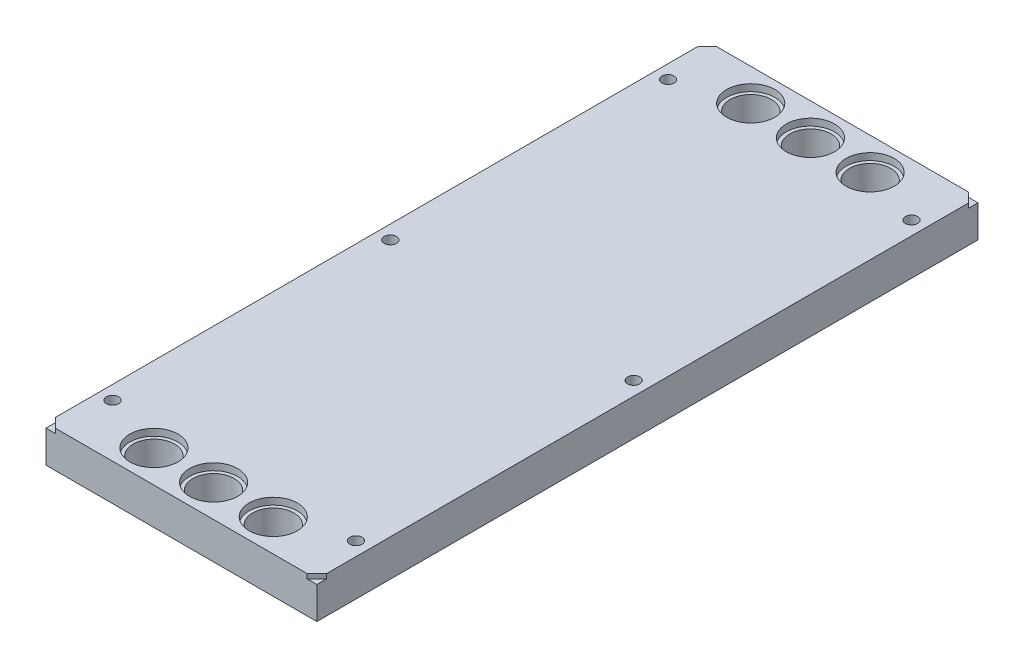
ISO-10303-21;
HEADER;
FILE_DESCRIPTION(('STEP AP214'),'2;1');
FILE_NAME('part.step','',(''),(''),'','','');
FILE_SCHEMA(('AUTOMOTIVE_DESIGN { 1 0 10303 214 1 1 1 1 }'));
ENDSEC;
DATA;
#1=APPLICATION_CONTEXT('core data for automotive mechanical design processes');
#2=APPLICATION_PROTOCOL_DEFINITION('international standard','automotive_design',2000,#1);
#3=PRODUCT_CONTEXT('',#1,'mechanical');
#4=PRODUCT('Part','Part','',(#3));
#5=PRODUCT_RELATED_PRODUCT_CATEGORY('part','',(#4));
#6=PRODUCT_DEFINITION_FORMATION('','',#4);
#7=PRODUCT_DEFINITION_CONTEXT('part definition',#1,'design');
#8=PRODUCT_DEFINITION('design','',#6,#7);
#9=PRODUCT_DEFINITION_SHAPE('','',#8);
#10=(LENGTH_UNIT() NAMED_UNIT(*) SI_UNIT(.MILLI.,.METRE.));
#11=(NAMED_UNIT(*) PLANE_ANGLE_UNIT() SI_UNIT($,.RADIAN.));
#12=(NAMED_UNIT(*) SI_UNIT($,.STERADIAN.) SOLID_ANGLE_UNIT());
#13=UNCERTAINTY_MEASURE_WITH_UNIT(LENGTH_MEASURE(1.E-05),#10,'distance_accuracy_value','');
#14=(GEOMETRIC_REPRESENTATION_CONTEXT(3) GLOBAL_UNCERTAINTY_ASSIGNED_CONTEXT((#13)) GLOBAL_UNIT_ASSIGNED_CONTEXT((#10,
#11,#12)) REPRESENTATION_CONTEXT('',''));
#15=CARTESIAN_POINT('',(0.,0.,0.));
#16=DIRECTION('',(0.,0.,1.));
#17=DIRECTION('',(1.,0.,0.));
#18=AXIS2_PLACEMENT_3D('',#15,#16,#17);
#19=CARTESIAN_POINT('',(93.6625,-25.4,228.6));
#20=DIRECTION('',(0.,-1.,0.));
#21=DIRECTION('',(1.,0.,0.));
#22=AXIS2_PLACEMENT_3D('',#19,#20,#21);
#23=PLANE('',#22);
#24=CARTESIAN_POINT('',(71.4375,-25.3999999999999,-101.6));
#25=DIRECTION('',(0.,-1.,0.));
#26=DIRECTION('',(0.,0.,-1.));
#27=AXIS2_PLACEMENT_3D('',#24,#25,#26);
#28=CIRCLE('',#27,3.9687465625);
#29=CARTESIAN_POINT('',(71.4375,-25.3999999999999,-105.5687465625));
#30=VERTEX_POINT('',#29);
#31=EDGE_CURVE('E439',#30,#30,#28,.T.);
#32=ORIENTED_EDGE('',*,*,#31,.F.);
#33=EDGE_LOOP('',(#32));
#34=FACE_BOUND('',#33,.T.);
#35=CARTESIAN_POINT('',(71.4375,-25.3999999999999,0.21890953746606));
#36=DIRECTION('',(0.,-1.,0.));
#37=DIRECTION('',(0.,0.,-1.));
#38=AXIS2_PLACEMENT_3D('',#35,#36,#37);
#39=CIRCLE('',#38,3.9687465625);
#40=CARTESIAN_POINT('',(71.4375,-25.3999999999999,-3.74983702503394));
#41=VERTEX_POINT('',#40);
#42=EDGE_CURVE('E451',#41,#41,#39,.T.);
#43=ORIENTED_EDGE('',*,*,#42,.F.);
#44=EDGE_LOOP('',(#43));
#45=FACE_BOUND('',#44,.T.);
#46=CARTESIAN_POINT('',(84.1375,-25.3999999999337,0.));
#47=DIRECTION('',(0.,-1.,0.));
#48=DIRECTION('',(0.,0.,-1.));
#49=AXIS2_PLACEMENT_3D('',#46,#47,#48);
#50=CIRCLE('',#49,6.74687499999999);
#51=CARTESIAN_POINT('',(84.1375,-25.3999999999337,-6.74687499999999));
#52=VERTEX_POINT('',#51);
#53=EDGE_CURVE('E478',#52,#52,#50,.T.);
#54=ORIENTED_EDGE('',*,*,#53,.F.);
#55=EDGE_LOOP('',(#54));
#56=FACE_BOUND('',#55,.T.);
#57=CARTESIAN_POINT('',(0.,-25.4,206.375));
#58=DIRECTION('',(0.,1.,0.));
#59=DIRECTION('',(-1.,0.,0.));
#60=AXIS2_PLACEMENT_3D('',#57,#58,#59);
#61=CIRCLE('',#60,14.2875);
#62=CARTESIAN_POINT('',(-14.2875,-25.4,206.375));
#63=VERTEX_POINT('',#62);
#64=EDGE_CURVE('E522',#63,#63,#61,.T.);
#65=ORIENTED_EDGE('',*,*,#64,.T.);
#66=EDGE_LOOP('',(#65));
#67=FACE_BOUND('',#66,.T.);
#68=CARTESIAN_POINT('',(0.,-25.4,-206.375));
#69=DIRECTION('',(0.,1.,0.));
#70=DIRECTION('',(-1.,0.,0.));
#71=AXIS2_PLACEMENT_3D('',#68,#69,#70);
#72=CIRCLE('',#71,14.2875);
#73=CARTESIAN_POINT('',(-14.2875,-25.4,-206.375));
#74=VERTEX_POINT('',#73);
#75=EDGE_CURVE('E525',#74,#74,#72,.T.);
#76=ORIENTED_EDGE('',*,*,#75,.T.);
#77=EDGE_LOOP('',(#76));
#78=FACE_BOUND('',#77,.T.);
#79=CARTESIAN_POINT('',(-41.275,-25.4,-206.375));
#80=DIRECTION('',(0.,1.,0.));
#81=DIRECTION('',(-1.,0.,0.));
#82=AXIS2_PLACEMENT_3D('',#79,#80,#81);
#83=CIRCLE('',#82,14.2875);
#84=CARTESIAN_POINT('',(-55.5625,-25.4,-206.375));
#85=VERTEX_POINT('',#84);
#86=EDGE_CURVE('E528',#85,#85,#83,.T.);
#87=ORIENTED_EDGE('',*,*,#86,.T.);
#88=EDGE_LOOP('',(#87));
#89=FACE_BOUND('',#88,.T.);
#90=CARTESIAN_POINT('',(-41.275,-25.4,206.375));
#91=DIRECTION('',(0.,1.,0.));
#92=DIRECTION('',(-1.,0.,0.));
#93=AXIS2_PLACEMENT_3D('',#90,#91,#92);
#94=CIRCLE('',#93,14.2875);
#95=CARTESIAN_POINT('',(-55.5625,-25.4,206.375));
#96=VERTEX_POINT('',#95);
#97=EDGE_CURVE('E531',#96,#96,#94,.T.);
#98=ORIENTED_EDGE('',*,*,#97,.T.);
#99=EDGE_LOOP('',(#98));
#100=FACE_BOUND('',#99,.T.);
#101=CARTESIAN_POINT('',(41.275,-25.4,206.375));
#102=DIRECTION('',(0.,1.,0.));
#103=DIRECTION('',(-1.,0.,0.));
#104=AXIS2_PLACEMENT_3D('',#101,#102,#103);
#105=CIRCLE('',#104,14.2875);
#106=CARTESIAN_POINT('',(26.9875,-25.4,206.375));
#107=VERTEX_POINT('',#106);
#108=EDGE_CURVE('E534',#107,#107,#105,.T.);
#109=ORIENTED_EDGE('',*,*,#108,.T.);
#110=EDGE_LOOP('',(#109));
#111=FACE_BOUND('',#110,.T.);
#112=CARTESIAN_POINT('',(41.275,-25.4,-206.375));
#113=DIRECTION('',(0.,1.,0.));
#114=DIRECTION('',(-1.,0.,0.));
#115=AXIS2_PLACEMENT_3D('',#112,#113,#114);
#116=CIRCLE('',#115,14.2875);
#117=CARTESIAN_POINT('',(26.9875,-25.4,-206.375));
#118=VERTEX_POINT('',#117);
#119=EDGE_CURVE('E537',#118,#118,#116,.T.);
#120=ORIENTED_EDGE('',*,*,#119,.T.);
#121=EDGE_LOOP('',(#120));
#122=FACE_BOUND('',#121,.T.);
#123=CARTESIAN_POINT('',(-71.4375,-25.3999999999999,-101.6));
#124=DIRECTION('',(0.,-1.,0.));
#125=DIRECTION('',(0.,0.,-1.));
#126=AXIS2_PLACEMENT_3D('',#123,#124,#125);
#127=CIRCLE('',#126,3.9687465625);
#128=CARTESIAN_POINT('',(-71.4375,-25.3999999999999,-105.5687465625));
#129=VERTEX_POINT('',#128);
#130=EDGE_CURVE('E546',#129,#129,#127,.T.);
#131=ORIENTED_EDGE('',*,*,#130,.F.);
#132=EDGE_LOOP('',(#131));
#133=FACE_BOUND('',#132,.T.);
#134=CARTESIAN_POINT('',(-71.4375,-25.3999999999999,0.21890953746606));
#135=DIRECTION('',(0.,-1.,0.));
#136=DIRECTION('',(0.,0.,-1.));
#137=AXIS2_PLACEMENT_3D('',#134,#135,#136);
#138=CIRCLE('',#137,3.9687465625);
#139=CARTESIAN_POINT('',(-71.4375,-25.3999999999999,-3.74983702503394));
#140=VERTEX_POINT('',#139);
#141=EDGE_CURVE('E558',#140,#140,#138,.T.);
#142=ORIENTED_EDGE('',*,*,#141,.F.);
#143=EDGE_LOOP('',(#142));
#144=FACE_BOUND('',#143,.T.);
#145=CARTESIAN_POINT('',(-71.4375,-25.3999999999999,-217.4875));
#146=DIRECTION('',(0.,-1.,0.));
#147=DIRECTION('',(0.,0.,-1.));
#148=AXIS2_PLACEMENT_3D('',#145,#146,#147);
#149=CIRCLE('',#148,3.9687465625);
#150=CARTESIAN_POINT('',(-71.4375,-25.3999999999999,-221.4562465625));
#151=VERTEX_POINT('',#150);
#152=EDGE_CURVE('E570',#151,#151,#149,.T.);
#153=ORIENTED_EDGE('',*,*,#152,.F.);
#154=EDGE_LOOP('',(#153));
#155=FACE_BOUND('',#154,.T.);
#156=CARTESIAN_POINT('',(-84.1375,-25.3999999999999,192.0875));
#157=DIRECTION('',(0.,-1.,0.));
#158=DIRECTION('',(0.,0.,-1.));
#159=AXIS2_PLACEMENT_3D('',#156,#157,#158);
#160=CIRCLE('',#159,6.74687499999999);
#161=CARTESIAN_POINT('',(-84.1375,-25.3999999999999,185.340625));
#162=VERTEX_POINT('',#161);
#163=EDGE_CURVE('E653',#162,#162,#160,.T.);
#164=ORIENTED_EDGE('',*,*,#163,.F.);
#165=EDGE_LOOP('',(#164));
#166=FACE_BOUND('',#165,.T.);
#167=CARTESIAN_POINT('',(84.1375,-25.4,-192.0875));
#168=DIRECTION('',(0.,-1.,0.));
#169=DIRECTION('',(0.,0.,-1.));
#170=AXIS2_PLACEMENT_3D('',#167,#168,#169);
#171=CIRCLE('',#170,6.74687499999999);
#172=CARTESIAN_POINT('',(84.1375,-25.4,-198.834375));
#173=VERTEX_POINT('',#172);
#174=EDGE_CURVE('E668',#173,#173,#171,.T.);
#175=ORIENTED_EDGE('',*,*,#174,.F.);
#176=EDGE_LOOP('',(#175));
#177=FACE_BOUND('',#176,.T.);
#178=DIRECTION('',(-1.,0.,0.));
#179=VECTOR('',#178,1.);
#180=CARTESIAN_POINT('',(93.6625,-25.4,-228.6));
#181=LINE('',#180,#179);
#182=CARTESIAN_POINT('',(93.6625,-25.4,-228.6));
#183=VERTEX_POINT('',#182);
#184=CARTESIAN_POINT('',(-93.6625,-25.3999999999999,-228.6));
#185=VERTEX_POINT('',#184);
#186=EDGE_CURVE('E694',#183,#185,#181,.T.);
#187=ORIENTED_EDGE('',*,*,#186,.F.);
#188=DIRECTION('',(0.,0.,-1.));
#189=VECTOR('',#188,1.);
#190=CARTESIAN_POINT('',(93.6625,-25.4,228.6));
#191=LINE('',#190,#189);
#192=CARTESIAN_POINT('',(93.6625,-25.4,228.6));
#193=VERTEX_POINT('',#192);
#194=EDGE_CURVE('E41',#193,#183,#191,.T.);
#195=ORIENTED_EDGE('',*,*,#194,.F.);
#196=DIRECTION('',(-1.,0.,0.));
#197=VECTOR('',#196,1.);
#198=CARTESIAN_POINT('',(93.6625,-25.4,228.6));
#199=LINE('',#198,#197);
#200=CARTESIAN_POINT('',(-93.6625,-25.3999999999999,228.6));
#201=VERTEX_POINT('',#200);
#202=EDGE_CURVE('E683',#193,#201,#199,.T.);
#203=ORIENTED_EDGE('',*,*,#202,.T.);
#204=DIRECTION('',(0.,0.,-1.));
#205=VECTOR('',#204,1.);
#206=CARTESIAN_POINT('',(-93.6625,-25.3999999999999,228.6));
#207=LINE('',#206,#205);
#208=EDGE_CURVE('E11',#201,#185,#207,.T.);
#209=ORIENTED_EDGE('',*,*,#208,.T.);
#210=EDGE_LOOP('',(#187,#195,#203,#209));
#211=FACE_BOUND('',#210,.T.);
#212=CARTESIAN_POINT('',(84.1375,-25.4,192.0875));
#213=DIRECTION('',(0.,-1.,0.));
#214=DIRECTION('',(0.,0.,-1.));
#215=AXIS2_PLACEMENT_3D('',#212,#213,#214);
#216=CIRCLE('',#215,6.74687499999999);
#217=CARTESIAN_POINT('',(84.1375,-25.4,185.340625));
#218=VERTEX_POINT('',#217);
#219=EDGE_CURVE('E665',#218,#218,#216,.T.);
#220=ORIENTED_EDGE('',*,*,#219,.F.);
#221=EDGE_LOOP('',(#220));
#222=FACE_BOUND('',#221,.T.);
#223=CARTESIAN_POINT('',(-84.1375,-25.3999999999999,-192.0875));
#224=DIRECTION('',(0.,-1.,0.));
#225=DIRECTION('',(0.,0.,-1.));
#226=AXIS2_PLACEMENT_3D('',#223,#224,#225);
#227=CIRCLE('',#226,6.74687499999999);
#228=CARTESIAN_POINT('',(-84.1375,-25.3999999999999,-198.834375));
#229=VERTEX_POINT('',#228);
#230=EDGE_CURVE('E641',#229,#229,#227,.T.);
#231=ORIENTED_EDGE('',*,*,#230,.F.);
#232=EDGE_LOOP('',(#231));
#233=FACE_BOUND('',#232,.T.);
#234=CARTESIAN_POINT('',(-71.4375,-25.3999999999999,217.4875));
#235=DIRECTION('',(0.,-1.,0.));
#236=DIRECTION('',(0.,0.,-1.));
#237=AXIS2_PLACEMENT_3D('',#234,#235,#236);
#238=CIRCLE('',#237,3.9687465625);
#239=CARTESIAN_POINT('',(-71.4375,-25.3999999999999,213.5187534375));
#240=VERTEX_POINT('',#239);
#241=EDGE_CURVE('E564',#240,#240,#238,.T.);
#242=ORIENTED_EDGE('',*,*,#241,.F.);
#243=EDGE_LOOP('',(#242));
#244=FACE_BOUND('',#243,.T.);
#245=CARTESIAN_POINT('',(-71.4375,-25.3999999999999,101.6));
#246=DIRECTION('',(0.,-1.,0.));
#247=DIRECTION('',(0.,0.,-1.));
#248=AXIS2_PLACEMENT_3D('',#245,#246,#247);
#249=CIRCLE('',#248,3.9687465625);
#250=CARTESIAN_POINT('',(-71.4375,-25.3999999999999,97.6312534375));
#251=VERTEX_POINT('',#250);
#252=EDGE_CURVE('E552',#251,#251,#249,.T.);
#253=ORIENTED_EDGE('',*,*,#252,.F.);
#254=EDGE_LOOP('',(#253));
#255=FACE_BOUND('',#254,.T.);
#256=CARTESIAN_POINT('',(71.4375,-25.3999999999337,-214.3125));
#257=DIRECTION('',(0.,-1.,0.));
#258=DIRECTION('',(0.,0.,-1.));
#259=AXIS2_PLACEMENT_3D('',#256,#257,#258);
#260=CIRCLE('',#259,3.9687465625);
#261=CARTESIAN_POINT('',(71.4375,-25.3999999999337,-218.2812465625));
#262=VERTEX_POINT('',#261);
#263=EDGE_CURVE('E540',#262,#262,#260,.T.);
#264=ORIENTED_EDGE('',*,*,#263,.F.);
#265=EDGE_LOOP('',(#264));
#266=FACE_BOUND('',#265,.T.);
#267=CARTESIAN_POINT('',(-84.1375,-25.3999999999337,0.));
#268=DIRECTION('',(0.,-1.,0.));
#269=DIRECTION('',(0.,0.,-1.));
#270=AXIS2_PLACEMENT_3D('',#267,#268,#269);
#271=CIRCLE('',#270,6.74687499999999);
#272=CARTESIAN_POINT('',(-84.1375,-25.3999999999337,-6.74687499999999));
#273=VERTEX_POINT('',#272);
#274=EDGE_CURVE('E466',#273,#273,#271,.T.);
#275=ORIENTED_EDGE('',*,*,#274,.F.);
#276=EDGE_LOOP('',(#275));
#277=FACE_BOUND('',#276,.T.);
#278=CARTESIAN_POINT('',(71.4375,-25.3999999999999,101.6));
#279=DIRECTION('',(0.,-1.,0.));
#280=DIRECTION('',(0.,0.,-1.));
#281=AXIS2_PLACEMENT_3D('',#278,#279,#280);
#282=CIRCLE('',#281,3.9687465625);
#283=CARTESIAN_POINT('',(71.4375,-25.3999999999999,97.6312534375));
#284=VERTEX_POINT('',#283);
#285=EDGE_CURVE('E438',#284,#284,#282,.T.);
#286=ORIENTED_EDGE('',*,*,#285,.F.);
#287=EDGE_LOOP('',(#286));
#288=FACE_BOUND('',#287,.T.);
#289=CARTESIAN_POINT('',(71.4375,-25.3999999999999,217.4875));
#290=DIRECTION('',(0.,-1.,0.));
#291=DIRECTION('',(0.,0.,-1.));
#292=AXIS2_PLACEMENT_3D('',#289,#290,#291);
#293=CIRCLE('',#292,3.9687465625);
#294=CARTESIAN_POINT('',(71.4375,-25.3999999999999,213.5187534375));
#295=VERTEX_POINT('',#294);
#296=EDGE_CURVE('E1224',#295,#295,#293,.T.);
#297=ORIENTED_EDGE('',*,*,#296,.F.);
#298=EDGE_LOOP('',(#297));
#299=FACE_BOUND('',#298,.T.);
#300=ADVANCED_FACE('F32',(#34,#45,#56,#67,#78,#89,#100,#111,#122,#133,#144,#155,#166,#177,#211,
#222,#233,#244,#255,#266,#277,#288,#299),#23,.T.);
#301=CARTESIAN_POINT('',(-93.6625,0.,228.6));
#302=DIRECTION('',(0.,1.,0.));
#303=DIRECTION('',(-1.,0.,0.));
#304=AXIS2_PLACEMENT_3D('',#301,#302,#303);
#305=PLANE('',#304);
#306=CARTESIAN_POINT('',(84.1375,1.00613961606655E-13,0.));
#307=DIRECTION('',(0.,-1.,0.));
#308=DIRECTION('',(0.,0.,-1.));
#309=AXIS2_PLACEMENT_3D('',#306,#307,#308);
#310=CIRCLE('',#309,4.21640000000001);
#311=CARTESIAN_POINT('',(84.1375,1.00613961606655E-13,-4.21640000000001));
#312=VERTEX_POINT('',#311);
#313=EDGE_CURVE('E469',#312,#312,#310,.T.);
#314=ORIENTED_EDGE('',*,*,#313,.T.);
#315=EDGE_LOOP('',(#314));
#316=FACE_BOUND('',#315,.T.);
#317=CARTESIAN_POINT('',(0.,-5.68433772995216E-11,206.375));
#318=DIRECTION('',(0.,1.,0.));
#319=DIRECTION('',(-1.,0.,0.));
#320=AXIS2_PLACEMENT_3D('',#317,#318,#319);
#321=CIRCLE('',#320,16.66875);
#322=CARTESIAN_POINT('',(-16.66875,-5.6843418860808E-11,206.375));
#323=VERTEX_POINT('',#322);
#324=EDGE_CURVE('E481',#323,#323,#321,.T.);
#325=ORIENTED_EDGE('',*,*,#324,.F.);
#326=EDGE_LOOP('',(#325));
#327=FACE_BOUND('',#326,.T.);
#328=CARTESIAN_POINT('',(0.,-5.6843435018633E-11,-206.375));
#329=DIRECTION('',(0.,1.,0.));
#330=DIRECTION('',(-1.,0.,0.));
#331=AXIS2_PLACEMENT_3D('',#328,#329,#330);
#332=CIRCLE('',#331,16.66875);
#333=CARTESIAN_POINT('',(-16.66875,-5.6843418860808E-11,-206.375));
#334=VERTEX_POINT('',#333);
#335=EDGE_CURVE('E491',#334,#334,#332,.T.);
#336=ORIENTED_EDGE('',*,*,#335,.F.);
#337=EDGE_LOOP('',(#336));
#338=FACE_BOUND('',#337,.T.);
#339=CARTESIAN_POINT('',(-41.275,0.,-206.375));
#340=DIRECTION('',(0.,1.,0.));
#341=DIRECTION('',(-1.,0.,0.));
#342=AXIS2_PLACEMENT_3D('',#339,#340,#341);
#343=CIRCLE('',#342,16.66875);
#344=CARTESIAN_POINT('',(-57.94375,0.,-206.375));
#345=VERTEX_POINT('',#344);
#346=EDGE_CURVE('E498',#345,#345,#343,.T.);
#347=ORIENTED_EDGE('',*,*,#346,.F.);
#348=EDGE_LOOP('',(#347));
#349=FACE_BOUND('',#348,.T.);
#350=CARTESIAN_POINT('',(-41.275,-5.68431222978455E-11,206.375));
#351=DIRECTION('',(0.,1.,0.));
#352=DIRECTION('',(-1.,0.,0.));
#353=AXIS2_PLACEMENT_3D('',#350,#351,#352);
#354=CIRCLE('',#353,16.66875);
#355=CARTESIAN_POINT('',(-57.94375,-5.6843418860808E-11,206.375));
#356=VERTEX_POINT('',#355);
#357=EDGE_CURVE('E505',#356,#356,#354,.T.);
#358=ORIENTED_EDGE('',*,*,#357,.F.);
#359=EDGE_LOOP('',(#358));
#360=FACE_BOUND('',#359,.T.);
#361=CARTESIAN_POINT('',(41.275,0.,206.375));
#362=DIRECTION('',(0.,1.,0.));
#363=DIRECTION('',(-1.,0.,0.));
#364=AXIS2_PLACEMENT_3D('',#361,#362,#363);
#365=CIRCLE('',#364,16.66875);
#366=CARTESIAN_POINT('',(24.60625,0.,206.375));
#367=VERTEX_POINT('',#366);
#368=EDGE_CURVE('E512',#367,#367,#365,.T.);
#369=ORIENTED_EDGE('',*,*,#368,.F.);
#370=EDGE_LOOP('',(#369));
#371=FACE_BOUND('',#370,.T.);
#372=CARTESIAN_POINT('',(41.275,0.,-206.375));
#373=DIRECTION('',(0.,1.,0.));
#374=DIRECTION('',(-1.,0.,0.));
#375=AXIS2_PLACEMENT_3D('',#372,#373,#374);
#376=CIRCLE('',#375,16.66875);
#377=CARTESIAN_POINT('',(24.60625,0.,-206.375));
#378=VERTEX_POINT('',#377);
#379=EDGE_CURVE('E519',#378,#378,#376,.T.);
#380=ORIENTED_EDGE('',*,*,#379,.F.);
#381=EDGE_LOOP('',(#380));
#382=FACE_BOUND('',#381,.T.);
#383=CARTESIAN_POINT('',(-84.1375,0.,192.0875));
#384=DIRECTION('',(0.,-1.,0.));
#385=DIRECTION('',(0.,0.,-1.));
#386=AXIS2_PLACEMENT_3D('',#383,#384,#385);
#387=CIRCLE('',#386,4.21639999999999);
#388=CARTESIAN_POINT('',(-84.1375,0.,187.8711));
#389=VERTEX_POINT('',#388);
#390=EDGE_CURVE('E644',#389,#389,#387,.T.);
#391=ORIENTED_EDGE('',*,*,#390,.T.);
#392=EDGE_LOOP('',(#391));
#393=FACE_BOUND('',#392,.T.);
#394=CARTESIAN_POINT('',(84.1375,0.,-192.0875));
#395=DIRECTION('',(0.,-1.,0.));
#396=DIRECTION('',(0.,0.,-1.));
#397=AXIS2_PLACEMENT_3D('',#394,#395,#396);
#398=CIRCLE('',#397,4.21639999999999);
#399=CARTESIAN_POINT('',(84.1375,0.,-196.3039));
#400=VERTEX_POINT('',#399);
#401=EDGE_CURVE('E677',#400,#400,#398,.T.);
#402=ORIENTED_EDGE('',*,*,#401,.T.);
#403=EDGE_LOOP('',(#402));
#404=FACE_BOUND('',#403,.T.);
#405=CARTESIAN_POINT('',(84.1375,0.,192.0875));
#406=DIRECTION('',(0.,-1.,0.));
#407=DIRECTION('',(0.,0.,-1.));
#408=AXIS2_PLACEMENT_3D('',#405,#406,#407);
#409=CIRCLE('',#408,4.21639999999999);
#410=CARTESIAN_POINT('',(84.1375,0.,187.8711));
#411=VERTEX_POINT('',#410);
#412=EDGE_CURVE('E656',#411,#411,#409,.T.);
#413=ORIENTED_EDGE('',*,*,#412,.T.);
#414=EDGE_LOOP('',(#413));
#415=FACE_BOUND('',#414,.T.);
#416=CARTESIAN_POINT('',(-84.1375,1.00613961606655E-13,-192.0875));
#417=DIRECTION('',(0.,-1.,0.));
#418=DIRECTION('',(0.,0.,-1.));
#419=AXIS2_PLACEMENT_3D('',#416,#417,#418);
#420=CIRCLE('',#419,4.21639999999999);
#421=CARTESIAN_POINT('',(-84.1375,1.00613961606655E-13,-196.3039));
#422=VERTEX_POINT('',#421);
#423=EDGE_CURVE('E632',#422,#422,#420,.T.);
#424=ORIENTED_EDGE('',*,*,#423,.T.);
#425=EDGE_LOOP('',(#424));
#426=FACE_BOUND('',#425,.T.);
#427=DIRECTION('',(1.,0.,0.));
#428=VECTOR('',#427,1.);
#429=CARTESIAN_POINT('',(-93.6625,0.,-228.6));
#430=LINE('',#429,#428);
#431=CARTESIAN_POINT('',(-86.9273079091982,0.,-228.6));
#432=VERTEX_POINT('',#431);
#433=CARTESIAN_POINT('',(86.9273079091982,0.,-228.6));
#434=VERTEX_POINT('',#433);
#435=EDGE_CURVE('E684',#432,#434,#430,.T.);
#436=ORIENTED_EDGE('',*,*,#435,.F.);
#437=DIRECTION('',(-0.707106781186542,0.,0.707106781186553));
#438=VECTOR('',#437,1.);
#439=CARTESIAN_POINT('',(-86.9273079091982,0.,-228.6));
#440=LINE('',#439,#438);
#441=CARTESIAN_POINT('',(-93.6625,0.,-221.864807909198));
#442=VERTEX_POINT('',#441);
#443=EDGE_CURVE('E576',#432,#442,#440,.T.);
#444=ORIENTED_EDGE('',*,*,#443,.T.);
#445=DIRECTION('',(0.,0.,-1.));
#446=VECTOR('',#445,1.);
#447=CARTESIAN_POINT('',(-93.6625,0.,228.6));
#448=LINE('',#447,#446);
#449=CARTESIAN_POINT('',(-93.6625,0.,221.864807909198));
#450=VERTEX_POINT('',#449);
#451=EDGE_CURVE('E692',#450,#442,#448,.T.);
#452=ORIENTED_EDGE('',*,*,#451,.F.);
#453=DIRECTION('',(-0.707106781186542,0.,-0.707106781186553));
#454=VECTOR('',#453,1.);
#455=CARTESIAN_POINT('',(-86.9273079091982,0.,228.6));
#456=LINE('',#455,#454);
#457=CARTESIAN_POINT('',(-86.9273079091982,0.,228.6));
#458=VERTEX_POINT('',#457);
#459=EDGE_CURVE('E603',#458,#450,#456,.T.);
#460=ORIENTED_EDGE('',*,*,#459,.F.);
#461=DIRECTION('',(1.,0.,0.));
#462=VECTOR('',#461,1.);
#463=CARTESIAN_POINT('',(-93.6625,0.,228.6));
#464=LINE('',#463,#462);
#465=CARTESIAN_POINT('',(86.9273079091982,0.,228.6));
#466=VERTEX_POINT('',#465);
#467=EDGE_CURVE('E690',#458,#466,#464,.T.);
#468=ORIENTED_EDGE('',*,*,#467,.T.);
#469=DIRECTION('',(0.707106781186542,0.,-0.707106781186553));
#470=VECTOR('',#469,1.);
#471=CARTESIAN_POINT('',(86.9273079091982,0.,228.6));
#472=LINE('',#471,#470);
#473=CARTESIAN_POINT('',(93.6625,0.,221.864807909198));
#474=VERTEX_POINT('',#473);
#475=EDGE_CURVE('E616',#466,#474,#472,.T.);
#476=ORIENTED_EDGE('',*,*,#475,.T.);
#477=DIRECTION('',(0.,0.,-1.));
#478=VECTOR('',#477,1.);
#479=CARTESIAN_POINT('',(93.6625,0.,228.6));
#480=LINE('',#479,#478);
#481=CARTESIAN_POINT('',(93.6625,0.,-221.864807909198));
#482=VERTEX_POINT('',#481);
#483=EDGE_CURVE('E703',#474,#482,#480,.T.);
#484=ORIENTED_EDGE('',*,*,#483,.T.);
#485=DIRECTION('',(0.707106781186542,0.,0.707106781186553));
#486=VECTOR('',#485,1.);
#487=CARTESIAN_POINT('',(86.9273079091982,0.,-228.6));
#488=LINE('',#487,#486);
#489=EDGE_CURVE('E590',#434,#482,#488,.T.);
#490=ORIENTED_EDGE('',*,*,#489,.F.);
#491=EDGE_LOOP('',(#436,#444,#452,#460,#468,#476,#484,#490));
#492=FACE_BOUND('',#491,.T.);
#493=CARTESIAN_POINT('',(-84.1375,1.2490009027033E-13,0.));
#494=DIRECTION('',(0.,-1.,0.));
#495=DIRECTION('',(0.,0.,-1.));
#496=AXIS2_PLACEMENT_3D('',#493,#494,#495);
#497=CIRCLE('',#496,4.21640000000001);
#498=CARTESIAN_POINT('',(-84.1375,1.2490009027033E-13,-4.21640000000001));
#499=VERTEX_POINT('',#498);
#500=EDGE_CURVE('E457',#499,#499,#497,.T.);
#501=ORIENTED_EDGE('',*,*,#500,.T.);
#502=EDGE_LOOP('',(#501));
#503=FACE_BOUND('',#502,.T.);
#504=ADVANCED_FACE('F169',(#316,#327,#338,#349,#360,#371,#382,#393,#404,#415,#426,#492,#503),
#305,.T.);
#505=CARTESIAN_POINT('',(0.,-25.4,206.375));
#506=DIRECTION('',(0.,1.,0.));
#507=DIRECTION('',(-1.,0.,0.));
#508=AXIS2_PLACEMENT_3D('',#505,#506,#507);
#509=CYLINDRICAL_SURFACE('',#508,14.2875);
#510=ORIENTED_EDGE('',*,*,#64,.F.);
#511=EDGE_LOOP('',(#510));
#512=FACE_BOUND('',#511,.T.);
#513=CARTESIAN_POINT('',(0.,-4.76250000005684,206.375));
#514=DIRECTION('',(0.,1.,0.));
#515=DIRECTION('',(-1.,0.,0.));
#516=AXIS2_PLACEMENT_3D('',#513,#514,#515);
#517=CIRCLE('',#516,14.2875);
#518=CARTESIAN_POINT('',(-14.2875,-4.76250000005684,206.375));
#519=VERTEX_POINT('',#518);
#520=EDGE_CURVE('E36',#519,#519,#517,.F.);
#521=ORIENTED_EDGE('',*,*,#520,.F.);
#522=EDGE_LOOP('',(#521));
#523=FACE_BOUND('',#522,.T.);
#524=ADVANCED_FACE('F174',(#512,#523),#509,.F.);
#525=CARTESIAN_POINT('',(0.,-25.4,-206.375));
#526=DIRECTION('',(0.,1.,0.));
#527=DIRECTION('',(-1.,0.,0.));
#528=AXIS2_PLACEMENT_3D('',#525,#526,#527);
#529=CYLINDRICAL_SURFACE('',#528,14.2875);
#530=ORIENTED_EDGE('',*,*,#75,.F.);
#531=EDGE_LOOP('',(#530));
#532=FACE_BOUND('',#531,.T.);
#533=CARTESIAN_POINT('',(0.,-4.76250000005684,-206.375));
#534=DIRECTION('',(0.,1.,0.));
#535=DIRECTION('',(-1.,0.,0.));
#536=AXIS2_PLACEMENT_3D('',#533,#534,#535);
#537=CIRCLE('',#536,14.2875);
#538=CARTESIAN_POINT('',(-14.2875,-4.76250000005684,-206.375));
#539=VERTEX_POINT('',#538);
#540=EDGE_CURVE('E490',#539,#539,#537,.F.);
#541=ORIENTED_EDGE('',*,*,#540,.F.);
#542=EDGE_LOOP('',(#541));
#543=FACE_BOUND('',#542,.T.);
#544=ADVANCED_FACE('F334',(#532,#543),#529,.F.);
#545=CARTESIAN_POINT('',(-41.275,-25.4,-206.375));
#546=DIRECTION('',(0.,1.,0.));
#547=DIRECTION('',(-1.,0.,0.));
#548=AXIS2_PLACEMENT_3D('',#545,#546,#547);
#549=CYLINDRICAL_SURFACE('',#548,14.2875);
#550=ORIENTED_EDGE('',*,*,#86,.F.);
#551=EDGE_LOOP('',(#550));
#552=FACE_BOUND('',#551,.T.);
#553=CARTESIAN_POINT('',(-41.275,-4.7625,-206.375));
#554=DIRECTION('',(0.,1.,0.));
#555=DIRECTION('',(-1.,0.,0.));
#556=AXIS2_PLACEMENT_3D('',#553,#554,#555);
#557=CIRCLE('',#556,14.2875);
#558=CARTESIAN_POINT('',(-55.5625,-4.7625,-206.375));
#559=VERTEX_POINT('',#558);
#560=EDGE_CURVE('E497',#559,#559,#557,.F.);
#561=ORIENTED_EDGE('',*,*,#560,.F.);
#562=EDGE_LOOP('',(#561));
#563=FACE_BOUND('',#562,.T.);
#564=ADVANCED_FACE('F330',(#552,#563),#549,.F.);
#565=CARTESIAN_POINT('',(-41.275,-25.4,206.375));
#566=DIRECTION('',(0.,1.,0.));
#567=DIRECTION('',(-1.,0.,0.));
#568=AXIS2_PLACEMENT_3D('',#565,#566,#567);
#569=CYLINDRICAL_SURFACE('',#568,14.2875);
#570=ORIENTED_EDGE('',*,*,#97,.F.);
#571=EDGE_LOOP('',(#570));
#572=FACE_BOUND('',#571,.T.);
#573=CARTESIAN_POINT('',(-41.275,-4.76250000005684,206.375));
#574=DIRECTION('',(0.,1.,0.));
#575=DIRECTION('',(-1.,0.,0.));
#576=AXIS2_PLACEMENT_3D('',#573,#574,#575);
#577=CIRCLE('',#576,14.2875);
#578=CARTESIAN_POINT('',(-55.5625,-4.76250000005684,206.375));
#579=VERTEX_POINT('',#578);
#580=EDGE_CURVE('E504',#579,#579,#577,.F.);
#581=ORIENTED_EDGE('',*,*,#580,.F.);
#582=EDGE_LOOP('',(#581));
#583=FACE_BOUND('',#582,.T.);
#584=ADVANCED_FACE('F326',(#572,#583),#569,.F.);
#585=CARTESIAN_POINT('',(41.275,-25.4,206.375));
#586=DIRECTION('',(0.,1.,0.));
#587=DIRECTION('',(-1.,0.,0.));
#588=AXIS2_PLACEMENT_3D('',#585,#586,#587);
#589=CYLINDRICAL_SURFACE('',#588,14.2875);
#590=ORIENTED_EDGE('',*,*,#108,.F.);
#591=EDGE_LOOP('',(#590));
#592=FACE_BOUND('',#591,.T.);
#593=CARTESIAN_POINT('',(41.275,-4.7625,206.375));
#594=DIRECTION('',(0.,1.,0.));
#595=DIRECTION('',(-1.,0.,0.));
#596=AXIS2_PLACEMENT_3D('',#593,#594,#595);
#597=CIRCLE('',#596,14.2875);
#598=CARTESIAN_POINT('',(26.9875,-4.7625,206.375));
#599=VERTEX_POINT('',#598);
#600=EDGE_CURVE('E511',#599,#599,#597,.F.);
#601=ORIENTED_EDGE('',*,*,#600,.F.);
#602=EDGE_LOOP('',(#601));
#603=FACE_BOUND('',#602,.T.);
#604=ADVANCED_FACE('F322',(#592,#603),#589,.F.);
#605=CARTESIAN_POINT('',(41.275,-25.4,-206.375));
#606=DIRECTION('',(0.,1.,0.));
#607=DIRECTION('',(-1.,0.,0.));
#608=AXIS2_PLACEMENT_3D('',#605,#606,#607);
#609=CYLINDRICAL_SURFACE('',#608,14.2875);
#610=ORIENTED_EDGE('',*,*,#119,.F.);
#611=EDGE_LOOP('',(#610));
#612=FACE_BOUND('',#611,.T.);
#613=CARTESIAN_POINT('',(41.275,-4.7625,-206.375));
#614=DIRECTION('',(0.,1.,0.));
#615=DIRECTION('',(-1.,0.,0.));
#616=AXIS2_PLACEMENT_3D('',#613,#614,#615);
#617=CIRCLE('',#616,14.2875);
#618=CARTESIAN_POINT('',(26.9875,-4.7625,-206.375));
#619=VERTEX_POINT('',#618);
#620=EDGE_CURVE('E518',#619,#619,#617,.F.);
#621=ORIENTED_EDGE('',*,*,#620,.F.);
#622=EDGE_LOOP('',(#621));
#623=FACE_BOUND('',#622,.T.);
#624=ADVANCED_FACE('F319',(#612,#623),#609,.F.);
#625=CARTESIAN_POINT('',(-93.6625,0.,228.6));
#626=DIRECTION('',(1.,0.,0.));
#627=DIRECTION('',(0.,0.,-1.));
#628=AXIS2_PLACEMENT_3D('',#625,#626,#627);
#629=PLANE('',#628);
#630=DIRECTION('',(0.,1.,0.));
#631=VECTOR('',#630,1.);
#632=CARTESIAN_POINT('',(-93.6625,-3.175,-221.864807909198));
#633=LINE('',#632,#631);
#634=CARTESIAN_POINT('',(-93.6625,-3.175,-221.864807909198));
#635=VERTEX_POINT('',#634);
#636=EDGE_CURVE('E585',#635,#442,#633,.T.);
#637=ORIENTED_EDGE('',*,*,#636,.F.);
#638=DIRECTION('',(0.,0.,-1.));
#639=VECTOR('',#638,1.);
#640=CARTESIAN_POINT('',(-93.6625,-3.175,-221.864807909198));
#641=LINE('',#640,#639);
#642=CARTESIAN_POINT('',(-93.6625,-3.175,-228.6));
#643=VERTEX_POINT('',#642);
#644=EDGE_CURVE('E582',#635,#643,#641,.T.);
#645=ORIENTED_EDGE('',*,*,#644,.T.);
#646=DIRECTION('',(0.,-1.,0.));
#647=VECTOR('',#646,1.);
#648=CARTESIAN_POINT('',(-93.6625,0.,-228.6));
#649=LINE('',#648,#647);
#650=EDGE_CURVE('E680',#643,#185,#649,.T.);
#651=ORIENTED_EDGE('',*,*,#650,.T.);
#652=ORIENTED_EDGE('',*,*,#208,.F.);
#653=DIRECTION('',(0.,-1.,0.));
#654=VECTOR('',#653,1.);
#655=CARTESIAN_POINT('',(-93.6625,0.,228.6));
#656=LINE('',#655,#654);
#657=CARTESIAN_POINT('',(-93.6625,-3.175,228.6));
#658=VERTEX_POINT('',#657);
#659=EDGE_CURVE('E681',#658,#201,#656,.T.);
#660=ORIENTED_EDGE('',*,*,#659,.F.);
#661=DIRECTION('',(0.,0.,1.));
#662=VECTOR('',#661,1.);
#663=CARTESIAN_POINT('',(-93.6625,-3.175,221.864807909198));
#664=LINE('',#663,#662);
#665=CARTESIAN_POINT('',(-93.6625,-3.175,221.864807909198));
#666=VERTEX_POINT('',#665);
#667=EDGE_CURVE('E606',#666,#658,#664,.T.);
#668=ORIENTED_EDGE('',*,*,#667,.F.);
#669=DIRECTION('',(0.,1.,0.));
#670=VECTOR('',#669,1.);
#671=CARTESIAN_POINT('',(-93.6625,-3.175,221.864807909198));
#672=LINE('',#671,#670);
#673=EDGE_CURVE('E613',#666,#450,#672,.T.);
#674=ORIENTED_EDGE('',*,*,#673,.T.);
#675=ORIENTED_EDGE('',*,*,#451,.T.);
#676=EDGE_LOOP('',(#637,#645,#651,#652,#660,#668,#674,#675));
#677=FACE_BOUND('',#676,.T.);
#678=ADVANCED_FACE('F34',(#677),#629,.F.);
#679=CARTESIAN_POINT('',(-93.6625,0.,-228.6));
#680=DIRECTION('',(0.,0.,1.));
#681=DIRECTION('',(1.,0.,0.));
#682=AXIS2_PLACEMENT_3D('',#679,#680,#681);
#683=PLANE('',#682);
#684=DIRECTION('',(0.,1.,0.));
#685=VECTOR('',#684,1.);
#686=CARTESIAN_POINT('',(-86.9273079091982,-3.175,-228.6));
#687=LINE('',#686,#685);
#688=CARTESIAN_POINT('',(-86.9273079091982,-3.175,-228.6));
#689=VERTEX_POINT('',#688);
#690=EDGE_CURVE('E49',#689,#432,#687,.T.);
#691=ORIENTED_EDGE('',*,*,#690,.T.);
#692=ORIENTED_EDGE('',*,*,#435,.T.);
#693=DIRECTION('',(0.,1.,0.));
#694=VECTOR('',#693,1.);
#695=CARTESIAN_POINT('',(86.9273079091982,-3.175,-228.6));
#696=LINE('',#695,#694);
#697=CARTESIAN_POINT('',(86.9273079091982,-3.175,-228.6));
#698=VERTEX_POINT('',#697);
#699=EDGE_CURVE('E596',#698,#434,#696,.T.);
#700=ORIENTED_EDGE('',*,*,#699,.F.);
#701=DIRECTION('',(-1.,0.,0.));
#702=VECTOR('',#701,1.);
#703=CARTESIAN_POINT('',(93.6625,-3.175,-228.6));
#704=LINE('',#703,#702);
#705=CARTESIAN_POINT('',(93.6625,-3.175,-228.6));
#706=VERTEX_POINT('',#705);
#707=EDGE_CURVE('E591',#706,#698,#704,.T.);
#708=ORIENTED_EDGE('',*,*,#707,.F.);
#709=DIRECTION('',(0.,1.,0.));
#710=VECTOR('',#709,1.);
#711=CARTESIAN_POINT('',(93.6625,-25.4,-228.6));
#712=LINE('',#711,#710);
#713=EDGE_CURVE('E697',#183,#706,#712,.T.);
#714=ORIENTED_EDGE('',*,*,#713,.F.);
#715=ORIENTED_EDGE('',*,*,#186,.T.);
#716=ORIENTED_EDGE('',*,*,#650,.F.);
#717=DIRECTION('',(1.,0.,0.));
#718=VECTOR('',#717,1.);
#719=CARTESIAN_POINT('',(-93.6625,-3.175,-228.6));
#720=LINE('',#719,#718);
#721=EDGE_CURVE('E577',#643,#689,#720,.T.);
#722=ORIENTED_EDGE('',*,*,#721,.T.);
#723=EDGE_LOOP('',(#691,#692,#700,#708,#714,#715,#716,#722));
#724=FACE_BOUND('',#723,.T.);
#725=ADVANCED_FACE('F183',(#724),#683,.F.);
#726=CARTESIAN_POINT('',(93.6625,-25.4,228.6));
#727=DIRECTION('',(-1.,0.,0.));
#728=DIRECTION('',(0.,0.,1.));
#729=AXIS2_PLACEMENT_3D('',#726,#727,#728);
#730=PLANE('',#729);
#731=DIRECTION('',(0.,0.,-1.));
#732=VECTOR('',#731,1.);
#733=CARTESIAN_POINT('',(93.6625,-3.175,-221.864807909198));
#734=LINE('',#733,#732);
#735=CARTESIAN_POINT('',(93.6625,-3.175,-221.864807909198));
#736=VERTEX_POINT('',#735);
#737=EDGE_CURVE('E57',#736,#706,#734,.T.);
#738=ORIENTED_EDGE('',*,*,#737,.F.);
#739=DIRECTION('',(0.,1.,0.));
#740=VECTOR('',#739,1.);
#741=CARTESIAN_POINT('',(93.6625,-3.175,-221.864807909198));
#742=LINE('',#741,#740);
#743=EDGE_CURVE('E600',#736,#482,#742,.T.);
#744=ORIENTED_EDGE('',*,*,#743,.T.);
#745=ORIENTED_EDGE('',*,*,#483,.F.);
#746=DIRECTION('',(0.,1.,0.));
#747=VECTOR('',#746,1.);
#748=CARTESIAN_POINT('',(93.6625,-3.175,221.864807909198));
#749=LINE('',#748,#747);
#750=CARTESIAN_POINT('',(93.6625,-3.175,221.864807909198));
#751=VERTEX_POINT('',#750);
#752=EDGE_CURVE('E625',#751,#474,#749,.T.);
#753=ORIENTED_EDGE('',*,*,#752,.F.);
#754=DIRECTION('',(0.,0.,1.));
#755=VECTOR('',#754,1.);
#756=CARTESIAN_POINT('',(93.6625,-3.175,221.864807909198));
#757=LINE('',#756,#755);
#758=CARTESIAN_POINT('',(93.6625,-3.175,228.6));
#759=VERTEX_POINT('',#758);
#760=EDGE_CURVE('E622',#751,#759,#757,.T.);
#761=ORIENTED_EDGE('',*,*,#760,.T.);
#762=DIRECTION('',(0.,1.,0.));
#763=VECTOR('',#762,1.);
#764=CARTESIAN_POINT('',(93.6625,-25.4,228.6));
#765=LINE('',#764,#763);
#766=EDGE_CURVE('E687',#193,#759,#765,.T.);
#767=ORIENTED_EDGE('',*,*,#766,.F.);
#768=ORIENTED_EDGE('',*,*,#194,.T.);
#769=ORIENTED_EDGE('',*,*,#713,.T.);
#770=EDGE_LOOP('',(#738,#744,#745,#753,#761,#767,#768,#769));
#771=FACE_BOUND('',#770,.T.);
#772=ADVANCED_FACE('F180',(#771),#730,.F.);
#773=CARTESIAN_POINT('',(-93.6625,0.,228.6));
#774=DIRECTION('',(0.,0.,1.));
#775=DIRECTION('',(1.,0.,0.));
#776=AXIS2_PLACEMENT_3D('',#773,#774,#775);
#777=PLANE('',#776);
#778=DIRECTION('',(0.,1.,0.));
#779=VECTOR('',#778,1.);
#780=CARTESIAN_POINT('',(-86.9273079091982,-3.175,228.6));
#781=LINE('',#780,#779);
#782=CARTESIAN_POINT('',(-86.9273079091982,-3.175,228.6));
#783=VERTEX_POINT('',#782);
#784=EDGE_CURVE('E610',#783,#458,#781,.T.);
#785=ORIENTED_EDGE('',*,*,#784,.F.);
#786=DIRECTION('',(1.,0.,0.));
#787=VECTOR('',#786,1.);
#788=CARTESIAN_POINT('',(-93.6625,-3.175,228.6));
#789=LINE('',#788,#787);
#790=EDGE_CURVE('E604',#658,#783,#789,.T.);
#791=ORIENTED_EDGE('',*,*,#790,.F.);
#792=ORIENTED_EDGE('',*,*,#659,.T.);
#793=ORIENTED_EDGE('',*,*,#202,.F.);
#794=ORIENTED_EDGE('',*,*,#766,.T.);
#795=DIRECTION('',(-1.,0.,0.));
#796=VECTOR('',#795,1.);
#797=CARTESIAN_POINT('',(93.6625,-3.175,228.6));
#798=LINE('',#797,#796);
#799=CARTESIAN_POINT('',(86.9273079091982,-3.175,228.6));
#800=VERTEX_POINT('',#799);
#801=EDGE_CURVE('E617',#759,#800,#798,.T.);
#802=ORIENTED_EDGE('',*,*,#801,.T.);
#803=DIRECTION('',(0.,1.,0.));
#804=VECTOR('',#803,1.);
#805=CARTESIAN_POINT('',(86.9273079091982,-3.175,228.6));
#806=LINE('',#805,#804);
#807=EDGE_CURVE('E629',#800,#466,#806,.T.);
#808=ORIENTED_EDGE('',*,*,#807,.T.);
#809=ORIENTED_EDGE('',*,*,#467,.F.);
#810=EDGE_LOOP('',(#785,#791,#792,#793,#794,#802,#808,#809));
#811=FACE_BOUND('',#810,.T.);
#812=ADVANCED_FACE('F182',(#811),#777,.T.);
#813=CARTESIAN_POINT('',(84.1375,-25.4,-192.0875));
#814=DIRECTION('',(0.,-1.,0.));
#815=DIRECTION('',(0.,0.,-1.));
#816=AXIS2_PLACEMENT_3D('',#813,#814,#815);
#817=CYLINDRICAL_SURFACE('',#816,4.21639999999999);
#818=CARTESIAN_POINT('',(84.1375,-17.4625,-192.0875));
#819=DIRECTION('',(0.,-1.,0.));
#820=DIRECTION('',(0.,0.,-1.));
#821=AXIS2_PLACEMENT_3D('',#818,#819,#820);
#822=CIRCLE('',#821,4.21639999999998);
#823=CARTESIAN_POINT('',(84.1375,-17.4625,-196.3039));
#824=VERTEX_POINT('',#823);
#825=EDGE_CURVE('E674',#824,#824,#822,.T.);
#826=ORIENTED_EDGE('',*,*,#825,.T.);
#827=EDGE_LOOP('',(#826));
#828=FACE_BOUND('',#827,.T.);
#829=ORIENTED_EDGE('',*,*,#401,.F.);
#830=EDGE_LOOP('',(#829));
#831=FACE_BOUND('',#830,.T.);
#832=ADVANCED_FACE('F191',(#828,#831),#817,.F.);
#833=CARTESIAN_POINT('',(88.3539,-17.4625,-192.0875));
#834=DIRECTION('',(0.,-1.,0.));
#835=DIRECTION('',(0.,0.,-1.));
#836=AXIS2_PLACEMENT_3D('',#833,#834,#835);
#837=PLANE('',#836);
#838=CARTESIAN_POINT('',(84.1375,-17.4625,-192.0875));
#839=DIRECTION('',(0.,-1.,0.));
#840=DIRECTION('',(0.,0.,-1.));
#841=AXIS2_PLACEMENT_3D('',#838,#839,#840);
#842=CIRCLE('',#841,6.74687499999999);
#843=CARTESIAN_POINT('',(84.1375,-17.4625,-198.834375));
#844=VERTEX_POINT('',#843);
#845=EDGE_CURVE('E671',#844,#844,#842,.T.);
#846=ORIENTED_EDGE('',*,*,#845,.T.);
#847=EDGE_LOOP('',(#846));
#848=FACE_BOUND('',#847,.T.);
#849=ORIENTED_EDGE('',*,*,#825,.F.);
#850=EDGE_LOOP('',(#849));
#851=FACE_BOUND('',#850,.T.);
#852=ADVANCED_FACE('F195',(#848,#851),#837,.T.);
#853=CARTESIAN_POINT('',(84.1375,-25.4,-192.0875));
#854=DIRECTION('',(0.,-1.,0.));
#855=DIRECTION('',(0.,0.,-1.));
#856=AXIS2_PLACEMENT_3D('',#853,#854,#855);
#857=CYLINDRICAL_SURFACE('',#856,6.74687499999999);
#858=ORIENTED_EDGE('',*,*,#174,.T.);
#859=EDGE_LOOP('',(#858));
#860=FACE_BOUND('',#859,.T.);
#861=ORIENTED_EDGE('',*,*,#845,.F.);
#862=EDGE_LOOP('',(#861));
#863=FACE_BOUND('',#862,.T.);
#864=ADVANCED_FACE('F199',(#860,#863),#857,.F.);
#865=CARTESIAN_POINT('',(84.1375,-25.4,192.0875));
#866=DIRECTION('',(0.,-1.,0.));
#867=DIRECTION('',(0.,0.,-1.));
#868=AXIS2_PLACEMENT_3D('',#865,#866,#867);
#869=CYLINDRICAL_SURFACE('',#868,6.74687499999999);
#870=ORIENTED_EDGE('',*,*,#219,.T.);
#871=EDGE_LOOP('',(#870));
#872=FACE_BOUND('',#871,.T.);
#873=CARTESIAN_POINT('',(84.1375,-17.4624999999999,192.0875));
#874=DIRECTION('',(0.,-1.,0.));
#875=DIRECTION('',(0.,0.,-1.));
#876=AXIS2_PLACEMENT_3D('',#873,#874,#875);
#877=CIRCLE('',#876,6.74687499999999);
#878=CARTESIAN_POINT('',(84.1375,-17.4624999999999,185.340625));
#879=VERTEX_POINT('',#878);
#880=EDGE_CURVE('E662',#879,#879,#877,.T.);
#881=ORIENTED_EDGE('',*,*,#880,.F.);
#882=EDGE_LOOP('',(#881));
#883=FACE_BOUND('',#882,.T.);
#884=ADVANCED_FACE('F203',(#872,#883),#869,.F.);
#885=CARTESIAN_POINT('',(88.3539,-17.4624999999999,192.0875));
#886=DIRECTION('',(0.,-1.,0.));
#887=DIRECTION('',(0.,0.,-1.));
#888=AXIS2_PLACEMENT_3D('',#885,#886,#887);
#889=PLANE('',#888);
#890=ORIENTED_EDGE('',*,*,#880,.T.);
#891=EDGE_LOOP('',(#890));
#892=FACE_BOUND('',#891,.T.);
#893=CARTESIAN_POINT('',(84.1375,-17.4624999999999,192.0875));
#894=DIRECTION('',(0.,-1.,0.));
#895=DIRECTION('',(0.,0.,-1.));
#896=AXIS2_PLACEMENT_3D('',#893,#894,#895);
#897=CIRCLE('',#896,4.21639999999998);
#898=CARTESIAN_POINT('',(84.1375,-17.4624999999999,187.8711));
#899=VERTEX_POINT('',#898);
#900=EDGE_CURVE('E659',#899,#899,#897,.T.);
#901=ORIENTED_EDGE('',*,*,#900,.F.);
#902=EDGE_LOOP('',(#901));
#903=FACE_BOUND('',#902,.T.);
#904=ADVANCED_FACE('F207',(#892,#903),#889,.T.);
#905=CARTESIAN_POINT('',(84.1375,-25.4,192.0875));
#906=DIRECTION('',(0.,-1.,0.));
#907=DIRECTION('',(0.,0.,-1.));
#908=AXIS2_PLACEMENT_3D('',#905,#906,#907);
#909=CYLINDRICAL_SURFACE('',#908,4.21639999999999);
#910=ORIENTED_EDGE('',*,*,#900,.T.);
#911=EDGE_LOOP('',(#910));
#912=FACE_BOUND('',#911,.T.);
#913=ORIENTED_EDGE('',*,*,#412,.F.);
#914=EDGE_LOOP('',(#913));
#915=FACE_BOUND('',#914,.T.);
#916=ADVANCED_FACE('F211',(#912,#915),#909,.F.);
#917=CARTESIAN_POINT('',(-84.1375,-25.3999999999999,192.0875));
#918=DIRECTION('',(0.,-1.,0.));
#919=DIRECTION('',(0.,0.,-1.));
#920=AXIS2_PLACEMENT_3D('',#917,#918,#919);
#921=CYLINDRICAL_SURFACE('',#920,6.74687499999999);
#922=ORIENTED_EDGE('',*,*,#163,.T.);
#923=EDGE_LOOP('',(#922));
#924=FACE_BOUND('',#923,.T.);
#925=CARTESIAN_POINT('',(-84.1375,-17.4624999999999,192.0875));
#926=DIRECTION('',(0.,-1.,0.));
#927=DIRECTION('',(0.,0.,-1.));
#928=AXIS2_PLACEMENT_3D('',#925,#926,#927);
#929=CIRCLE('',#928,6.74687499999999);
#930=CARTESIAN_POINT('',(-84.1375,-17.4624999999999,185.340625));
#931=VERTEX_POINT('',#930);
#932=EDGE_CURVE('E650',#931,#931,#929,.T.);
#933=ORIENTED_EDGE('',*,*,#932,.F.);
#934=EDGE_LOOP('',(#933));
#935=FACE_BOUND('',#934,.T.);
#936=ADVANCED_FACE('F215',(#924,#935),#921,.F.);
#937=CARTESIAN_POINT('',(-79.9211,-17.4624999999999,192.0875));
#938=DIRECTION('',(0.,-1.,0.));
#939=DIRECTION('',(0.,0.,-1.));
#940=AXIS2_PLACEMENT_3D('',#937,#938,#939);
#941=PLANE('',#940);
#942=ORIENTED_EDGE('',*,*,#932,.T.);
#943=EDGE_LOOP('',(#942));
#944=FACE_BOUND('',#943,.T.);
#945=CARTESIAN_POINT('',(-84.1375,-17.4624999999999,192.0875));
#946=DIRECTION('',(0.,-1.,0.));
#947=DIRECTION('',(0.,0.,-1.));
#948=AXIS2_PLACEMENT_3D('',#945,#946,#947);
#949=CIRCLE('',#948,4.21639999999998);
#950=CARTESIAN_POINT('',(-84.1375,-17.4624999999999,187.8711));
#951=VERTEX_POINT('',#950);
#952=EDGE_CURVE('E647',#951,#951,#949,.T.);
#953=ORIENTED_EDGE('',*,*,#952,.F.);
#954=EDGE_LOOP('',(#953));
#955=FACE_BOUND('',#954,.T.);
#956=ADVANCED_FACE('F219',(#944,#955),#941,.T.);
#957=CARTESIAN_POINT('',(-84.1375,-25.3999999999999,192.0875));
#958=DIRECTION('',(0.,-1.,0.));
#959=DIRECTION('',(0.,0.,-1.));
#960=AXIS2_PLACEMENT_3D('',#957,#958,#959);
#961=CYLINDRICAL_SURFACE('',#960,4.21639999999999);
#962=ORIENTED_EDGE('',*,*,#952,.T.);
#963=EDGE_LOOP('',(#962));
#964=FACE_BOUND('',#963,.T.);
#965=ORIENTED_EDGE('',*,*,#390,.F.);
#966=EDGE_LOOP('',(#965));
#967=FACE_BOUND('',#966,.T.);
#968=ADVANCED_FACE('F223',(#964,#967),#961,.F.);
#969=CARTESIAN_POINT('',(-84.1375,-25.3999999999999,-192.0875));
#970=DIRECTION('',(0.,-1.,0.));
#971=DIRECTION('',(0.,0.,-1.));
#972=AXIS2_PLACEMENT_3D('',#969,#970,#971);
#973=CYLINDRICAL_SURFACE('',#972,6.74687499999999);
#974=ORIENTED_EDGE('',*,*,#230,.T.);
#975=EDGE_LOOP('',(#974));
#976=FACE_BOUND('',#975,.T.);
#977=CARTESIAN_POINT('',(-84.1375,-17.4624999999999,-192.0875));
#978=DIRECTION('',(0.,-1.,0.));
#979=DIRECTION('',(0.,0.,-1.));
#980=AXIS2_PLACEMENT_3D('',#977,#978,#979);
#981=CIRCLE('',#980,6.74687499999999);
#982=CARTESIAN_POINT('',(-84.1375,-17.4624999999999,-198.834375));
#983=VERTEX_POINT('',#982);
#984=EDGE_CURVE('E638',#983,#983,#981,.T.);
#985=ORIENTED_EDGE('',*,*,#984,.F.);
#986=EDGE_LOOP('',(#985));
#987=FACE_BOUND('',#986,.T.);
#988=ADVANCED_FACE('F227',(#976,#987),#973,.F.);
#989=CARTESIAN_POINT('',(-79.9211000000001,-17.4624999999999,-192.0875));
#990=DIRECTION('',(0.,-1.,0.));
#991=DIRECTION('',(0.,0.,-1.));
#992=AXIS2_PLACEMENT_3D('',#989,#990,#991);
#993=PLANE('',#992);
#994=ORIENTED_EDGE('',*,*,#984,.T.);
#995=EDGE_LOOP('',(#994));
#996=FACE_BOUND('',#995,.T.);
#997=CARTESIAN_POINT('',(-84.1375,-17.4624999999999,-192.0875));
#998=DIRECTION('',(0.,-1.,0.));
#999=DIRECTION('',(0.,0.,-1.));
#1000=AXIS2_PLACEMENT_3D('',#997,#998,#999);
#1001=CIRCLE('',#1000,4.21639999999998);
#1002=CARTESIAN_POINT('',(-84.1375,-17.4624999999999,-196.3039));
#1003=VERTEX_POINT('',#1002);
#1004=EDGE_CURVE('E635',#1003,#1003,#1001,.T.);
#1005=ORIENTED_EDGE('',*,*,#1004,.F.);
#1006=EDGE_LOOP('',(#1005));
#1007=FACE_BOUND('',#1006,.T.);
#1008=ADVANCED_FACE('F231',(#996,#1007),#993,.T.);
#1009=CARTESIAN_POINT('',(-84.1375,-25.3999999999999,-192.0875));
#1010=DIRECTION('',(0.,-1.,0.));
#1011=DIRECTION('',(0.,0.,-1.));
#1012=AXIS2_PLACEMENT_3D('',#1009,#1010,#1011);
#1013=CYLINDRICAL_SURFACE('',#1012,4.21639999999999);
#1014=ORIENTED_EDGE('',*,*,#1004,.T.);
#1015=EDGE_LOOP('',(#1014));
#1016=FACE_BOUND('',#1015,.T.);
#1017=ORIENTED_EDGE('',*,*,#423,.F.);
#1018=EDGE_LOOP('',(#1017));
#1019=FACE_BOUND('',#1018,.T.);
#1020=ADVANCED_FACE('F235',(#1016,#1019),#1013,.F.);
#1021=CARTESIAN_POINT('',(86.9273079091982,-3.175,228.6));
#1022=DIRECTION('',(0.707106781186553,0.,0.707106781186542));
#1023=DIRECTION('',(0.707106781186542,0.,-0.707106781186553));
#1024=AXIS2_PLACEMENT_3D('',#1021,#1022,#1023);
#1025=PLANE('',#1024);
#1026=ORIENTED_EDGE('',*,*,#475,.F.);
#1027=ORIENTED_EDGE('',*,*,#807,.F.);
#1028=DIRECTION('',(0.707106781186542,0.,-0.707106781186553));
#1029=VECTOR('',#1028,1.);
#1030=CARTESIAN_POINT('',(86.9273079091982,-3.175,228.6));
#1031=LINE('',#1030,#1029);
#1032=EDGE_CURVE('E620',#800,#751,#1031,.T.);
#1033=ORIENTED_EDGE('',*,*,#1032,.T.);
#1034=ORIENTED_EDGE('',*,*,#752,.T.);
#1035=EDGE_LOOP('',(#1026,#1027,#1033,#1034));
#1036=FACE_BOUND('',#1035,.T.);
#1037=ADVANCED_FACE('F239',(#1036),#1025,.T.);
#1038=CARTESIAN_POINT('',(93.6625,-3.175,228.6));
#1039=DIRECTION('',(0.,1.,0.));
#1040=DIRECTION('',(-1.,0.,0.));
#1041=AXIS2_PLACEMENT_3D('',#1038,#1039,#1040);
#1042=PLANE('',#1041);
#1043=ORIENTED_EDGE('',*,*,#801,.F.);
#1044=ORIENTED_EDGE('',*,*,#760,.F.);
#1045=ORIENTED_EDGE('',*,*,#1032,.F.);
#1046=EDGE_LOOP('',(#1043,#1044,#1045));
#1047=FACE_BOUND('',#1046,.T.);
#1048=ADVANCED_FACE('F243',(#1047),#1042,.T.);
#1049=CARTESIAN_POINT('',(-86.9273079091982,-3.175,228.6));
#1050=DIRECTION('',(0.707106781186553,0.,-0.707106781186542));
#1051=DIRECTION('',(-0.707106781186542,0.,-0.707106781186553));
#1052=AXIS2_PLACEMENT_3D('',#1049,#1050,#1051);
#1053=PLANE('',#1052);
#1054=ORIENTED_EDGE('',*,*,#459,.T.);
#1055=ORIENTED_EDGE('',*,*,#673,.F.);
#1056=DIRECTION('',(-0.707106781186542,0.,-0.707106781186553));
#1057=VECTOR('',#1056,1.);
#1058=CARTESIAN_POINT('',(-86.9273079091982,-3.175,228.6));
#1059=LINE('',#1058,#1057);
#1060=EDGE_CURVE('E608',#783,#666,#1059,.T.);
#1061=ORIENTED_EDGE('',*,*,#1060,.F.);
#1062=ORIENTED_EDGE('',*,*,#784,.T.);
#1063=EDGE_LOOP('',(#1054,#1055,#1061,#1062));
#1064=FACE_BOUND('',#1063,.T.);
#1065=ADVANCED_FACE('F247',(#1064),#1053,.F.);
#1066=CARTESIAN_POINT('',(-93.6625,-3.175,228.6));
#1067=DIRECTION('',(0.,1.,0.));
#1068=DIRECTION('',(1.,0.,0.));
#1069=AXIS2_PLACEMENT_3D('',#1066,#1067,#1068);
#1070=PLANE('',#1069);
#1071=ORIENTED_EDGE('',*,*,#790,.T.);
#1072=ORIENTED_EDGE('',*,*,#1060,.T.);
#1073=ORIENTED_EDGE('',*,*,#667,.T.);
#1074=EDGE_LOOP('',(#1071,#1072,#1073));
#1075=FACE_BOUND('',#1074,.T.);
#1076=ADVANCED_FACE('F251',(#1075),#1070,.T.);
#1077=CARTESIAN_POINT('',(86.9273079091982,-3.175,-228.6));
#1078=DIRECTION('',(-0.707106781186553,0.,0.707106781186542));
#1079=DIRECTION('',(0.707106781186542,0.,0.707106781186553));
#1080=AXIS2_PLACEMENT_3D('',#1077,#1078,#1079);
#1081=PLANE('',#1080);
#1082=ORIENTED_EDGE('',*,*,#489,.T.);
#1083=ORIENTED_EDGE('',*,*,#743,.F.);
#1084=DIRECTION('',(0.707106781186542,0.,0.707106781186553));
#1085=VECTOR('',#1084,1.);
#1086=CARTESIAN_POINT('',(86.9273079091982,-3.175,-228.6));
#1087=LINE('',#1086,#1085);
#1088=EDGE_CURVE('E594',#698,#736,#1087,.T.);
#1089=ORIENTED_EDGE('',*,*,#1088,.F.);
#1090=ORIENTED_EDGE('',*,*,#699,.T.);
#1091=EDGE_LOOP('',(#1082,#1083,#1089,#1090));
#1092=FACE_BOUND('',#1091,.T.);
#1093=ADVANCED_FACE('F255',(#1092),#1081,.F.);
#1094=CARTESIAN_POINT('',(93.6625,-3.175,-228.6));
#1095=DIRECTION('',(0.,1.,0.));
#1096=DIRECTION('',(-1.,0.,0.));
#1097=AXIS2_PLACEMENT_3D('',#1094,#1095,#1096);
#1098=PLANE('',#1097);
#1099=ORIENTED_EDGE('',*,*,#707,.T.);
#1100=ORIENTED_EDGE('',*,*,#1088,.T.);
#1101=ORIENTED_EDGE('',*,*,#737,.T.);
#1102=EDGE_LOOP('',(#1099,#1100,#1101));
#1103=FACE_BOUND('',#1102,.T.);
#1104=ADVANCED_FACE('F259',(#1103),#1098,.T.);
#1105=CARTESIAN_POINT('',(-86.9273079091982,-3.175,-228.6));
#1106=DIRECTION('',(-0.707106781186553,0.,-0.707106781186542));
#1107=DIRECTION('',(-0.707106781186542,0.,0.707106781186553));
#1108=AXIS2_PLACEMENT_3D('',#1105,#1106,#1107);
#1109=PLANE('',#1108);
#1110=ORIENTED_EDGE('',*,*,#443,.F.);
#1111=ORIENTED_EDGE('',*,*,#690,.F.);
#1112=DIRECTION('',(-0.707106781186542,0.,0.707106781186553));
#1113=VECTOR('',#1112,1.);
#1114=CARTESIAN_POINT('',(-86.9273079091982,-3.175,-228.6));
#1115=LINE('',#1114,#1113);
#1116=EDGE_CURVE('E580',#689,#635,#1115,.T.);
#1117=ORIENTED_EDGE('',*,*,#1116,.T.);
#1118=ORIENTED_EDGE('',*,*,#636,.T.);
#1119=EDGE_LOOP('',(#1110,#1111,#1117,#1118));
#1120=FACE_BOUND('',#1119,.T.);
#1121=ADVANCED_FACE('F263',(#1120),#1109,.T.);
#1122=CARTESIAN_POINT('',(-93.6625,-3.175,-228.6));
#1123=DIRECTION('',(0.,1.,0.));
#1124=DIRECTION('',(1.,0.,0.));
#1125=AXIS2_PLACEMENT_3D('',#1122,#1123,#1124);
#1126=PLANE('',#1125);
#1127=ORIENTED_EDGE('',*,*,#721,.F.);
#1128=ORIENTED_EDGE('',*,*,#644,.F.);
#1129=ORIENTED_EDGE('',*,*,#1116,.F.);
#1130=EDGE_LOOP('',(#1127,#1128,#1129));
#1131=FACE_BOUND('',#1130,.T.);
#1132=ADVANCED_FACE('F266',(#1131),#1126,.T.);
#1133=CARTESIAN_POINT('',(-71.4375,-7.14035023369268,-217.4875));
#1134=DIRECTION('',(0.,-1.,0.));
#1135=DIRECTION('',(0.,0.,-1.));
#1136=AXIS2_PLACEMENT_3D('',#1133,#1134,#1135);
#1137=CONICAL_SURFACE('',#1136,0.,1.02974425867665);
#1138=CARTESIAN_POINT('',(-71.4375,-9.52501374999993,-217.4875));
#1139=DIRECTION('',(0.,-1.,0.));
#1140=DIRECTION('',(0.,0.,-1.));
#1141=AXIS2_PLACEMENT_3D('',#1138,#1139,#1140);
#1142=CIRCLE('',#1141,3.96874656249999);
#1143=CARTESIAN_POINT('',(-71.4375,-9.52501374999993,-221.4562465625));
#1144=VERTEX_POINT('',#1143);
#1145=EDGE_CURVE('E573',#1144,#1144,#1142,.T.);
#1146=ORIENTED_EDGE('',*,*,#1145,.T.);
#1147=EDGE_LOOP('',(#1146));
#1148=FACE_BOUND('',#1147,.T.);
#1149=CARTESIAN_POINT('',(-71.4375,-7.14035023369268,-217.4875));
#1150=VERTEX_POINT('',#1149);
#1151=VERTEX_LOOP('',#1150);
#1152=FACE_BOUND('',#1151,.T.);
#1153=ADVANCED_FACE('F269',(#1148,#1152),#1137,.F.);
#1154=CARTESIAN_POINT('',(-71.4375,-25.3999999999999,-217.4875));
#1155=DIRECTION('',(0.,-1.,0.));
#1156=DIRECTION('',(0.,0.,-1.));
#1157=AXIS2_PLACEMENT_3D('',#1154,#1155,#1156);
#1158=CYLINDRICAL_SURFACE('',#1157,3.96874656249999);
#1159=ORIENTED_EDGE('',*,*,#152,.T.);
#1160=EDGE_LOOP('',(#1159));
#1161=FACE_BOUND('',#1160,.T.);
#1162=ORIENTED_EDGE('',*,*,#1145,.F.);
#1163=EDGE_LOOP('',(#1162));
#1164=FACE_BOUND('',#1163,.T.);
#1165=ADVANCED_FACE('F273',(#1161,#1164),#1158,.F.);
#1166=CARTESIAN_POINT('',(-71.4375,-7.14035023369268,217.4875));
#1167=DIRECTION('',(0.,-1.,0.));
#1168=DIRECTION('',(0.,0.,-1.));
#1169=AXIS2_PLACEMENT_3D('',#1166,#1167,#1168);
#1170=CONICAL_SURFACE('',#1169,0.,1.02974425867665);
#1171=CARTESIAN_POINT('',(-71.4375,-9.52501374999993,217.4875));
#1172=DIRECTION('',(0.,-1.,0.));
#1173=DIRECTION('',(0.,0.,-1.));
#1174=AXIS2_PLACEMENT_3D('',#1171,#1172,#1173);
#1175=CIRCLE('',#1174,3.96874656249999);
#1176=CARTESIAN_POINT('',(-71.4375,-9.52501374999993,213.5187534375));
#1177=VERTEX_POINT('',#1176);
#1178=EDGE_CURVE('E567',#1177,#1177,#1175,.T.);
#1179=ORIENTED_EDGE('',*,*,#1178,.T.);
#1180=EDGE_LOOP('',(#1179));
#1181=FACE_BOUND('',#1180,.T.);
#1182=CARTESIAN_POINT('',(-71.4375,-7.14035023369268,217.4875));
#1183=VERTEX_POINT('',#1182);
#1184=VERTEX_LOOP('',#1183);
#1185=FACE_BOUND('',#1184,.T.);
#1186=ADVANCED_FACE('F277',(#1181,#1185),#1170,.F.);
#1187=CARTESIAN_POINT('',(-71.4375,-25.3999999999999,217.4875));
#1188=DIRECTION('',(0.,-1.,0.));
#1189=DIRECTION('',(0.,0.,-1.));
#1190=AXIS2_PLACEMENT_3D('',#1187,#1188,#1189);
#1191=CYLINDRICAL_SURFACE('',#1190,3.96874656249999);
#1192=ORIENTED_EDGE('',*,*,#241,.T.);
#1193=EDGE_LOOP('',(#1192));
#1194=FACE_BOUND('',#1193,.T.);
#1195=ORIENTED_EDGE('',*,*,#1178,.F.);
#1196=EDGE_LOOP('',(#1195));
#1197=FACE_BOUND('',#1196,.T.);
#1198=ADVANCED_FACE('F281',(#1194,#1197),#1191,.F.);
#1199=CARTESIAN_POINT('',(-71.4375,-7.14035023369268,0.21890953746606));
#1200=DIRECTION('',(0.,-1.,0.));
#1201=DIRECTION('',(0.,0.,-1.));
#1202=AXIS2_PLACEMENT_3D('',#1199,#1200,#1201);
#1203=CONICAL_SURFACE('',#1202,0.,1.02974425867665);
#1204=CARTESIAN_POINT('',(-71.4375,-9.52501374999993,0.21890953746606));
#1205=DIRECTION('',(0.,-1.,0.));
#1206=DIRECTION('',(0.,0.,-1.));
#1207=AXIS2_PLACEMENT_3D('',#1204,#1205,#1206);
#1208=CIRCLE('',#1207,3.96874656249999);
#1209=CARTESIAN_POINT('',(-71.4375,-9.52501374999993,-3.74983702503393));
#1210=VERTEX_POINT('',#1209);
#1211=EDGE_CURVE('E561',#1210,#1210,#1208,.T.);
#1212=ORIENTED_EDGE('',*,*,#1211,.T.);
#1213=EDGE_LOOP('',(#1212));
#1214=FACE_BOUND('',#1213,.T.);
#1215=CARTESIAN_POINT('',(-71.4375,-7.14035023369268,0.21890953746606));
#1216=VERTEX_POINT('',#1215);
#1217=VERTEX_LOOP('',#1216);
#1218=FACE_BOUND('',#1217,.T.);
#1219=ADVANCED_FACE('F285',(#1214,#1218),#1203,.F.);
#1220=CARTESIAN_POINT('',(-71.4375,-25.3999999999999,0.21890953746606));
#1221=DIRECTION('',(0.,-1.,0.));
#1222=DIRECTION('',(0.,0.,-1.));
#1223=AXIS2_PLACEMENT_3D('',#1220,#1221,#1222);
#1224=CYLINDRICAL_SURFACE('',#1223,3.96874656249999);
#1225=ORIENTED_EDGE('',*,*,#141,.T.);
#1226=EDGE_LOOP('',(#1225));
#1227=FACE_BOUND('',#1226,.T.);
#1228=ORIENTED_EDGE('',*,*,#1211,.F.);
#1229=EDGE_LOOP('',(#1228));
#1230=FACE_BOUND('',#1229,.T.);
#1231=ADVANCED_FACE('F289',(#1227,#1230),#1224,.F.);
#1232=CARTESIAN_POINT('',(-71.4375,-7.14035023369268,101.6));
#1233=DIRECTION('',(0.,-1.,0.));
#1234=DIRECTION('',(0.,0.,-1.));
#1235=AXIS2_PLACEMENT_3D('',#1232,#1233,#1234);
#1236=CONICAL_SURFACE('',#1235,0.,1.02974425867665);
#1237=CARTESIAN_POINT('',(-71.4375,-9.52501374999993,101.6));
#1238=DIRECTION('',(0.,-1.,0.));
#1239=DIRECTION('',(0.,0.,-1.));
#1240=AXIS2_PLACEMENT_3D('',#1237,#1238,#1239);
#1241=CIRCLE('',#1240,3.96874656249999);
#1242=CARTESIAN_POINT('',(-71.4375,-9.52501374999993,97.6312534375));
#1243=VERTEX_POINT('',#1242);
#1244=EDGE_CURVE('E555',#1243,#1243,#1241,.T.);
#1245=ORIENTED_EDGE('',*,*,#1244,.T.);
#1246=EDGE_LOOP('',(#1245));
#1247=FACE_BOUND('',#1246,.T.);
#1248=CARTESIAN_POINT('',(-71.4375,-7.14035023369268,101.6));
#1249=VERTEX_POINT('',#1248);
#1250=VERTEX_LOOP('',#1249);
#1251=FACE_BOUND('',#1250,.T.);
#1252=ADVANCED_FACE('F293',(#1247,#1251),#1236,.F.);
#1253=CARTESIAN_POINT('',(-71.4375,-25.3999999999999,101.6));
#1254=DIRECTION('',(0.,-1.,0.));
#1255=DIRECTION('',(0.,0.,-1.));
#1256=AXIS2_PLACEMENT_3D('',#1253,#1254,#1255);
#1257=CYLINDRICAL_SURFACE('',#1256,3.96874656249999);
#1258=ORIENTED_EDGE('',*,*,#252,.T.);
#1259=EDGE_LOOP('',(#1258));
#1260=FACE_BOUND('',#1259,.T.);
#1261=ORIENTED_EDGE('',*,*,#1244,.F.);
#1262=EDGE_LOOP('',(#1261));
#1263=FACE_BOUND('',#1262,.T.);
#1264=ADVANCED_FACE('F297',(#1260,#1263),#1257,.F.);
#1265=CARTESIAN_POINT('',(-71.4375,-7.14035023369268,-101.6));
#1266=DIRECTION('',(0.,-1.,0.));
#1267=DIRECTION('',(0.,0.,-1.));
#1268=AXIS2_PLACEMENT_3D('',#1265,#1266,#1267);
#1269=CONICAL_SURFACE('',#1268,0.,1.02974425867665);
#1270=CARTESIAN_POINT('',(-71.4375,-9.52501374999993,-101.6));
#1271=DIRECTION('',(0.,-1.,0.));
#1272=DIRECTION('',(0.,0.,-1.));
#1273=AXIS2_PLACEMENT_3D('',#1270,#1271,#1272);
#1274=CIRCLE('',#1273,3.96874656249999);
#1275=CARTESIAN_POINT('',(-71.4375,-9.52501374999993,-105.5687465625));
#1276=VERTEX_POINT('',#1275);
#1277=EDGE_CURVE('E549',#1276,#1276,#1274,.T.);
#1278=ORIENTED_EDGE('',*,*,#1277,.T.);
#1279=EDGE_LOOP('',(#1278));
#1280=FACE_BOUND('',#1279,.T.);
#1281=CARTESIAN_POINT('',(-71.4375,-7.14035023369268,-101.6));
#1282=VERTEX_POINT('',#1281);
#1283=VERTEX_LOOP('',#1282);
#1284=FACE_BOUND('',#1283,.T.);
#1285=ADVANCED_FACE('F301',(#1280,#1284),#1269,.F.);
#1286=CARTESIAN_POINT('',(-71.4375,-25.3999999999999,-101.6));
#1287=DIRECTION('',(0.,-1.,0.));
#1288=DIRECTION('',(0.,0.,-1.));
#1289=AXIS2_PLACEMENT_3D('',#1286,#1287,#1288);
#1290=CYLINDRICAL_SURFACE('',#1289,3.96874656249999);
#1291=ORIENTED_EDGE('',*,*,#130,.T.);
#1292=EDGE_LOOP('',(#1291));
#1293=FACE_BOUND('',#1292,.T.);
#1294=ORIENTED_EDGE('',*,*,#1277,.F.);
#1295=EDGE_LOOP('',(#1294));
#1296=FACE_BOUND('',#1295,.T.);
#1297=ADVANCED_FACE('F305',(#1293,#1296),#1290,.F.);
#1298=CARTESIAN_POINT('',(71.4375,-7.14035023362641,-214.3125));
#1299=DIRECTION('',(0.,-1.,0.));
#1300=DIRECTION('',(0.,0.,-1.));
#1301=AXIS2_PLACEMENT_3D('',#1298,#1299,#1300);
#1302=CONICAL_SURFACE('',#1301,0.,1.02974425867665);
#1303=CARTESIAN_POINT('',(71.4375,-9.52501374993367,-214.3125));
#1304=DIRECTION('',(0.,-1.,0.));
#1305=DIRECTION('',(0.,0.,-1.));
#1306=AXIS2_PLACEMENT_3D('',#1303,#1304,#1305);
#1307=CIRCLE('',#1306,3.96874656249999);
#1308=CARTESIAN_POINT('',(71.4375,-9.52501374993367,-218.2812465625));
#1309=VERTEX_POINT('',#1308);
#1310=EDGE_CURVE('E543',#1309,#1309,#1307,.T.);
#1311=ORIENTED_EDGE('',*,*,#1310,.T.);
#1312=EDGE_LOOP('',(#1311));
#1313=FACE_BOUND('',#1312,.T.);
#1314=CARTESIAN_POINT('',(71.4375,-7.14035023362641,-214.3125));
#1315=VERTEX_POINT('',#1314);
#1316=VERTEX_LOOP('',#1315);
#1317=FACE_BOUND('',#1316,.T.);
#1318=ADVANCED_FACE('F309',(#1313,#1317),#1302,.F.);
#1319=CARTESIAN_POINT('',(71.4375,-25.3999999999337,-214.3125));
#1320=DIRECTION('',(0.,-1.,0.));
#1321=DIRECTION('',(0.,0.,-1.));
#1322=AXIS2_PLACEMENT_3D('',#1319,#1320,#1321);
#1323=CYLINDRICAL_SURFACE('',#1322,3.96874656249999);
#1324=ORIENTED_EDGE('',*,*,#263,.T.);
#1325=EDGE_LOOP('',(#1324));
#1326=FACE_BOUND('',#1325,.T.);
#1327=ORIENTED_EDGE('',*,*,#1310,.F.);
#1328=EDGE_LOOP('',(#1327));
#1329=FACE_BOUND('',#1328,.T.);
#1330=ADVANCED_FACE('F313',(#1326,#1329),#1323,.F.);
#1331=CARTESIAN_POINT('',(41.275,-4.7625,-206.375));
#1332=DIRECTION('',(0.,1.,0.));
#1333=DIRECTION('',(-1.,0.,0.));
#1334=AXIS2_PLACEMENT_3D('',#1331,#1332,#1333);
#1335=PLANE('',#1334);
#1336=CARTESIAN_POINT('',(41.275,-4.7625,-206.375));
#1337=DIRECTION('',(0.,1.,0.));
#1338=DIRECTION('',(-1.,0.,0.));
#1339=AXIS2_PLACEMENT_3D('',#1336,#1337,#1338);
#1340=CIRCLE('',#1339,16.66875);
#1341=CARTESIAN_POINT('',(24.60625,-4.7625,-206.375));
#1342=VERTEX_POINT('',#1341);
#1343=EDGE_CURVE('E515',#1342,#1342,#1340,.T.);
#1344=ORIENTED_EDGE('',*,*,#1343,.T.);
#1345=EDGE_LOOP('',(#1344));
#1346=FACE_BOUND('',#1345,.T.);
#1347=ORIENTED_EDGE('',*,*,#620,.T.);
#1348=EDGE_LOOP('',(#1347));
#1349=FACE_BOUND('',#1348,.T.);
#1350=ADVANCED_FACE('F317',(#1346,#1349),#1335,.T.);
#1351=CARTESIAN_POINT('',(41.275,-4.7625,-206.375));
#1352=DIRECTION('',(0.,1.,0.));
#1353=DIRECTION('',(-1.,0.,0.));
#1354=AXIS2_PLACEMENT_3D('',#1351,#1352,#1353);
#1355=CYLINDRICAL_SURFACE('',#1354,16.66875);
#1356=CARTESIAN_POINT('',(24.60625,-4.7625,-206.375));
#1357=CARTESIAN_POINT('',(24.60625,-4.712890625,-206.375));
#1358=CARTESIAN_POINT('',(24.60625,-4.66328125,-206.375));
#1359=CARTESIAN_POINT('',(24.60625,-4.5640625,-206.375));
#1360=CARTESIAN_POINT('',(24.60625,-4.514453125,-206.375));
#1361=CARTESIAN_POINT('',(24.60625,-4.415234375,-206.375));
#1362=CARTESIAN_POINT('',(24.60625,-4.365625,-206.375));
#1363=CARTESIAN_POINT('',(24.60625,-4.26640625,-206.375));
#1364=CARTESIAN_POINT('',(24.60625,-4.216796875,-206.375));
#1365=CARTESIAN_POINT('',(24.60625,-4.117578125,-206.375));
#1366=CARTESIAN_POINT('',(24.60625,-4.06796875,-206.375));
#1367=CARTESIAN_POINT('',(24.60625,-3.96875,-206.375));
#1368=CARTESIAN_POINT('',(24.60625,-3.919140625,-206.375));
#1369=CARTESIAN_POINT('',(24.60625,-3.819921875,-206.375));
#1370=CARTESIAN_POINT('',(24.60625,-3.7703125,-206.375));
#1371=CARTESIAN_POINT('',(24.60625,-3.67109375,-206.375));
#1372=CARTESIAN_POINT('',(24.60625,-3.621484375,-206.375));
#1373=CARTESIAN_POINT('',(24.60625,-3.522265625,-206.375));
#1374=CARTESIAN_POINT('',(24.60625,-3.47265625,-206.375));
#1375=CARTESIAN_POINT('',(24.60625,-3.3734375,-206.375));
#1376=CARTESIAN_POINT('',(24.60625,-3.323828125,-206.375));
#1377=CARTESIAN_POINT('',(24.60625,-3.224609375,-206.375));
#1378=CARTESIAN_POINT('',(24.60625,-3.175,-206.375));
#1379=CARTESIAN_POINT('',(24.60625,-3.07578125,-206.375));
#1380=CARTESIAN_POINT('',(24.60625,-3.026171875,-206.375));
#1381=CARTESIAN_POINT('',(24.60625,-2.926953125,-206.375));
#1382=CARTESIAN_POINT('',(24.60625,-2.87734375,-206.375));
#1383=CARTESIAN_POINT('',(24.60625,-2.778125,-206.375));
#1384=CARTESIAN_POINT('',(24.60625,-2.728515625,-206.375));
#1385=CARTESIAN_POINT('',(24.60625,-2.629296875,-206.375));
#1386=CARTESIAN_POINT('',(24.60625,-2.5796875,-206.375));
#1387=CARTESIAN_POINT('',(24.60625,-2.48046875,-206.375));
#1388=CARTESIAN_POINT('',(24.60625,-2.430859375,-206.375));
#1389=CARTESIAN_POINT('',(24.60625,-2.331640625,-206.375));
#1390=CARTESIAN_POINT('',(24.60625,-2.28203125,-206.375));
#1391=CARTESIAN_POINT('',(24.60625,-2.1828125,-206.375));
#1392=CARTESIAN_POINT('',(24.60625,-2.133203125,-206.375));
#1393=CARTESIAN_POINT('',(24.60625,-2.033984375,-206.375));
#1394=CARTESIAN_POINT('',(24.60625,-1.984375,-206.375));
#1395=CARTESIAN_POINT('',(24.60625,-1.88515625,-206.375));
#1396=CARTESIAN_POINT('',(24.60625,-1.835546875,-206.375));
#1397=CARTESIAN_POINT('',(24.60625,-1.736328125,-206.375));
#1398=CARTESIAN_POINT('',(24.60625,-1.68671875,-206.375));
#1399=CARTESIAN_POINT('',(24.60625,-1.5875,-206.375));
#1400=CARTESIAN_POINT('',(24.60625,-1.537890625,-206.375));
#1401=CARTESIAN_POINT('',(24.60625,-1.438671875,-206.375));
#1402=CARTESIAN_POINT('',(24.60625,-1.3890625,-206.375));
#1403=CARTESIAN_POINT('',(24.60625,-1.28984375,-206.375));
#1404=CARTESIAN_POINT('',(24.60625,-1.240234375,-206.375));
#1405=CARTESIAN_POINT('',(24.60625,-1.141015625,-206.375));
#1406=CARTESIAN_POINT('',(24.60625,-1.09140625,-206.375));
#1407=CARTESIAN_POINT('',(24.60625,-0.992187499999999,-206.375));
#1408=CARTESIAN_POINT('',(24.60625,-0.942578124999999,-206.375));
#1409=CARTESIAN_POINT('',(24.60625,-0.843359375,-206.375));
#1410=CARTESIAN_POINT('',(24.60625,-0.79375,-206.375));
#1411=CARTESIAN_POINT('',(24.60625,-0.69453125,-206.375));
#1412=CARTESIAN_POINT('',(24.60625,-0.644921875,-206.375));
#1413=CARTESIAN_POINT('',(24.60625,-0.545703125,-206.375));
#1414=CARTESIAN_POINT('',(24.60625,-0.49609375,-206.375));
#1415=CARTESIAN_POINT('',(24.60625,-0.396875,-206.375));
#1416=CARTESIAN_POINT('',(24.60625,-0.347265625,-206.375));
#1417=CARTESIAN_POINT('',(24.60625,-0.248046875,-206.375));
#1418=CARTESIAN_POINT('',(24.60625,-0.1984375,-206.375));
#1419=CARTESIAN_POINT('',(24.60625,-0.09921875,-206.375));
#1420=CARTESIAN_POINT('',(24.60625,-0.049609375,-206.375));
#1421=CARTESIAN_POINT('',(24.60625,0.,-206.375));
#1422=B_SPLINE_CURVE_WITH_KNOTS('',3,(#1356,#1357,#1358,#1359,#1360,#1361,#1362,#1363,#1364,
#1365,#1366,#1367,#1368,#1369,#1370,#1371,#1372,#1373,#1374,#1375,#1376,#1377,#1378,#1379,#1380,
#1381,#1382,#1383,#1384,#1385,#1386,#1387,#1388,#1389,#1390,#1391,#1392,#1393,#1394,#1395,#1396,
#1397,#1398,#1399,#1400,#1401,#1402,#1403,#1404,#1405,#1406,#1407,#1408,#1409,#1410,#1411,#1412,
#1413,#1414,#1415,#1416,#1417,#1418,#1419,#1420,#1421),.UNSPECIFIED.,.F.,.F.,(4,2,2,2,2,2,2,2,2,
2,2,2,2,2,2,2,2,2,2,2,2,2,2,2,2,2,2,2,2,2,2,2,4),(0.,0.148828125,0.29765625,0.446484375,
0.5953125,0.744140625,0.892968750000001,1.041796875,1.190625,1.339453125,1.48828125,1.637109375,
1.7859375,1.934765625,2.08359375,2.232421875,2.38125,2.530078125,2.67890625,2.827734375,
2.9765625,3.125390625,3.27421875,3.423046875,3.571875,3.720703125,3.86953125,4.018359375,
4.1671875,4.316015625,4.46484375,4.613671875,4.7625),.UNSPECIFIED.);
#1423=EDGE_CURVE('BSEAM342',#1342,#378,#1422,.T.);
#1424=ORIENTED_EDGE('',*,*,#1343,.F.);
#1425=ORIENTED_EDGE('',*,*,#379,.T.);
#1426=ORIENTED_EDGE('',*,*,#1423,.T.);
#1427=ORIENTED_EDGE('',*,*,#1423,.F.);
#1428=EDGE_LOOP('',(#1424,#1426,#1425,#1427));
#1429=FACE_BOUND('',#1428,.T.);
#1430=ADVANCED_FACE('F342',(#1429),#1355,.F.);
#1431=CARTESIAN_POINT('',(41.275,-4.7625,206.375));
#1432=DIRECTION('',(0.,1.,0.));
#1433=DIRECTION('',(-1.,0.,0.));
#1434=AXIS2_PLACEMENT_3D('',#1431,#1432,#1433);
#1435=PLANE('',#1434);
#1436=CARTESIAN_POINT('',(41.275,-4.7625,206.375));
#1437=DIRECTION('',(0.,1.,0.));
#1438=DIRECTION('',(-1.,0.,0.));
#1439=AXIS2_PLACEMENT_3D('',#1436,#1437,#1438);
#1440=CIRCLE('',#1439,16.66875);
#1441=CARTESIAN_POINT('',(24.60625,-4.7625,206.375));
#1442=VERTEX_POINT('',#1441);
#1443=EDGE_CURVE('E508',#1442,#1442,#1440,.T.);
#1444=ORIENTED_EDGE('',*,*,#1443,.T.);
#1445=EDGE_LOOP('',(#1444));
#1446=FACE_BOUND('',#1445,.T.);
#1447=ORIENTED_EDGE('',*,*,#600,.T.);
#1448=EDGE_LOOP('',(#1447));
#1449=FACE_BOUND('',#1448,.T.);
#1450=ADVANCED_FACE('F345',(#1446,#1449),#1435,.T.);
#1451=CARTESIAN_POINT('',(41.275,-4.7625,206.375));
#1452=DIRECTION('',(0.,1.,0.));
#1453=DIRECTION('',(-1.,0.,0.));
#1454=AXIS2_PLACEMENT_3D('',#1451,#1452,#1453);
#1455=CYLINDRICAL_SURFACE('',#1454,16.66875);
#1456=CARTESIAN_POINT('',(24.60625,-4.7625,206.375));
#1457=CARTESIAN_POINT('',(24.60625,-4.712890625,206.375));
#1458=CARTESIAN_POINT('',(24.60625,-4.66328125,206.375));
#1459=CARTESIAN_POINT('',(24.60625,-4.5640625,206.375));
#1460=CARTESIAN_POINT('',(24.60625,-4.514453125,206.375));
#1461=CARTESIAN_POINT('',(24.60625,-4.415234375,206.375));
#1462=CARTESIAN_POINT('',(24.60625,-4.365625,206.375));
#1463=CARTESIAN_POINT('',(24.60625,-4.26640625,206.375));
#1464=CARTESIAN_POINT('',(24.60625,-4.216796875,206.375));
#1465=CARTESIAN_POINT('',(24.60625,-4.117578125,206.375));
#1466=CARTESIAN_POINT('',(24.60625,-4.06796875,206.375));
#1467=CARTESIAN_POINT('',(24.60625,-3.96875,206.375));
#1468=CARTESIAN_POINT('',(24.60625,-3.919140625,206.375));
#1469=CARTESIAN_POINT('',(24.60625,-3.819921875,206.375));
#1470=CARTESIAN_POINT('',(24.60625,-3.7703125,206.375));
#1471=CARTESIAN_POINT('',(24.60625,-3.67109375,206.375));
#1472=CARTESIAN_POINT('',(24.60625,-3.621484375,206.375));
#1473=CARTESIAN_POINT('',(24.60625,-3.522265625,206.375));
#1474=CARTESIAN_POINT('',(24.60625,-3.47265625,206.375));
#1475=CARTESIAN_POINT('',(24.60625,-3.3734375,206.375));
#1476=CARTESIAN_POINT('',(24.60625,-3.323828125,206.375));
#1477=CARTESIAN_POINT('',(24.60625,-3.224609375,206.375));
#1478=CARTESIAN_POINT('',(24.60625,-3.175,206.375));
#1479=CARTESIAN_POINT('',(24.60625,-3.07578125,206.375));
#1480=CARTESIAN_POINT('',(24.60625,-3.026171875,206.375));
#1481=CARTESIAN_POINT('',(24.60625,-2.926953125,206.375));
#1482=CARTESIAN_POINT('',(24.60625,-2.87734375,206.375));
#1483=CARTESIAN_POINT('',(24.60625,-2.778125,206.375));
#1484=CARTESIAN_POINT('',(24.60625,-2.728515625,206.375));
#1485=CARTESIAN_POINT('',(24.60625,-2.629296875,206.375));
#1486=CARTESIAN_POINT('',(24.60625,-2.5796875,206.375));
#1487=CARTESIAN_POINT('',(24.60625,-2.48046875,206.375));
#1488=CARTESIAN_POINT('',(24.60625,-2.430859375,206.375));
#1489=CARTESIAN_POINT('',(24.60625,-2.331640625,206.375));
#1490=CARTESIAN_POINT('',(24.60625,-2.28203125,206.375));
#1491=CARTESIAN_POINT('',(24.60625,-2.1828125,206.375));
#1492=CARTESIAN_POINT('',(24.60625,-2.133203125,206.375));
#1493=CARTESIAN_POINT('',(24.60625,-2.033984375,206.375));
#1494=CARTESIAN_POINT('',(24.60625,-1.984375,206.375));
#1495=CARTESIAN_POINT('',(24.60625,-1.88515625,206.375));
#1496=CARTESIAN_POINT('',(24.60625,-1.835546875,206.375));
#1497=CARTESIAN_POINT('',(24.60625,-1.736328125,206.375));
#1498=CARTESIAN_POINT('',(24.60625,-1.68671875,206.375));
#1499=CARTESIAN_POINT('',(24.60625,-1.5875,206.375));
#1500=CARTESIAN_POINT('',(24.60625,-1.537890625,206.375));
#1501=CARTESIAN_POINT('',(24.60625,-1.438671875,206.375));
#1502=CARTESIAN_POINT('',(24.60625,-1.3890625,206.375));
#1503=CARTESIAN_POINT('',(24.60625,-1.28984375,206.375));
#1504=CARTESIAN_POINT('',(24.60625,-1.240234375,206.375));
#1505=CARTESIAN_POINT('',(24.60625,-1.141015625,206.375));
#1506=CARTESIAN_POINT('',(24.60625,-1.09140625,206.375));
#1507=CARTESIAN_POINT('',(24.60625,-0.992187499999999,206.375));
#1508=CARTESIAN_POINT('',(24.60625,-0.942578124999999,206.375));
#1509=CARTESIAN_POINT('',(24.60625,-0.843359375,206.375));
#1510=CARTESIAN_POINT('',(24.60625,-0.79375,206.375));
#1511=CARTESIAN_POINT('',(24.60625,-0.69453125,206.375));
#1512=CARTESIAN_POINT('',(24.60625,-0.644921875,206.375));
#1513=CARTESIAN_POINT('',(24.60625,-0.545703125,206.375));
#1514=CARTESIAN_POINT('',(24.60625,-0.49609375,206.375));
#1515=CARTESIAN_POINT('',(24.60625,-0.396875,206.375));
#1516=CARTESIAN_POINT('',(24.60625,-0.347265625,206.375));
#1517=CARTESIAN_POINT('',(24.60625,-0.248046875,206.375));
#1518=CARTESIAN_POINT('',(24.60625,-0.1984375,206.375));
#1519=CARTESIAN_POINT('',(24.60625,-0.09921875,206.375));
#1520=CARTESIAN_POINT('',(24.60625,-0.049609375,206.375));
#1521=CARTESIAN_POINT('',(24.60625,0.,206.375));
#1522=B_SPLINE_CURVE_WITH_KNOTS('',3,(#1456,#1457,#1458,#1459,#1460,#1461,#1462,#1463,#1464,
#1465,#1466,#1467,#1468,#1469,#1470,#1471,#1472,#1473,#1474,#1475,#1476,#1477,#1478,#1479,#1480,
#1481,#1482,#1483,#1484,#1485,#1486,#1487,#1488,#1489,#1490,#1491,#1492,#1493,#1494,#1495,#1496,
#1497,#1498,#1499,#1500,#1501,#1502,#1503,#1504,#1505,#1506,#1507,#1508,#1509,#1510,#1511,#1512,
#1513,#1514,#1515,#1516,#1517,#1518,#1519,#1520,#1521),.UNSPECIFIED.,.F.,.F.,(4,2,2,2,2,2,2,2,2,
2,2,2,2,2,2,2,2,2,2,2,2,2,2,2,2,2,2,2,2,2,2,2,4),(0.,0.148828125,0.29765625,0.446484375,
0.5953125,0.744140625,0.892968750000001,1.041796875,1.190625,1.339453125,1.48828125,1.637109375,
1.7859375,1.934765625,2.08359375,2.232421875,2.38125,2.530078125,2.67890625,2.827734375,
2.9765625,3.125390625,3.27421875,3.423046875,3.571875,3.720703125,3.86953125,4.018359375,
4.1671875,4.316015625,4.46484375,4.613671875,4.7625),.UNSPECIFIED.);
#1523=EDGE_CURVE('BSEAM350',#1442,#367,#1522,.T.);
#1524=ORIENTED_EDGE('',*,*,#1443,.F.);
#1525=ORIENTED_EDGE('',*,*,#368,.T.);
#1526=ORIENTED_EDGE('',*,*,#1523,.T.);
#1527=ORIENTED_EDGE('',*,*,#1523,.F.);
#1528=EDGE_LOOP('',(#1524,#1526,#1525,#1527));
#1529=FACE_BOUND('',#1528,.T.);
#1530=ADVANCED_FACE('F350',(#1529),#1455,.F.);
#1531=CARTESIAN_POINT('',(-41.275,-4.76250000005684,206.375));
#1532=DIRECTION('',(0.,1.,0.));
#1533=DIRECTION('',(-1.,0.,0.));
#1534=AXIS2_PLACEMENT_3D('',#1531,#1532,#1533);
#1535=PLANE('',#1534);
#1536=CARTESIAN_POINT('',(-41.275,-4.76250000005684,206.375));
#1537=DIRECTION('',(0.,1.,0.));
#1538=DIRECTION('',(-1.,0.,0.));
#1539=AXIS2_PLACEMENT_3D('',#1536,#1537,#1538);
#1540=CIRCLE('',#1539,16.66875);
#1541=CARTESIAN_POINT('',(-57.94375,-4.76250000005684,206.375));
#1542=VERTEX_POINT('',#1541);
#1543=EDGE_CURVE('E501',#1542,#1542,#1540,.T.);
#1544=ORIENTED_EDGE('',*,*,#1543,.T.);
#1545=EDGE_LOOP('',(#1544));
#1546=FACE_BOUND('',#1545,.T.);
#1547=ORIENTED_EDGE('',*,*,#580,.T.);
#1548=EDGE_LOOP('',(#1547));
#1549=FACE_BOUND('',#1548,.T.);
#1550=ADVANCED_FACE('F353',(#1546,#1549),#1535,.T.);
#1551=CARTESIAN_POINT('',(-41.275,-4.76250000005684,206.375));
#1552=DIRECTION('',(0.,1.,0.));
#1553=DIRECTION('',(-1.,0.,0.));
#1554=AXIS2_PLACEMENT_3D('',#1551,#1552,#1553);
#1555=CYLINDRICAL_SURFACE('',#1554,16.66875);
#1556=CARTESIAN_POINT('',(-57.94375,-4.76250000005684,206.375));
#1557=CARTESIAN_POINT('',(-57.94375,-4.71289062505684,206.375));
#1558=CARTESIAN_POINT('',(-57.94375,-4.66328125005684,206.375));
#1559=CARTESIAN_POINT('',(-57.94375,-4.56406250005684,206.375));
#1560=CARTESIAN_POINT('',(-57.94375,-4.51445312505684,206.375));
#1561=CARTESIAN_POINT('',(-57.94375,-4.41523437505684,206.375));
#1562=CARTESIAN_POINT('',(-57.94375,-4.36562500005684,206.375));
#1563=CARTESIAN_POINT('',(-57.94375,-4.26640625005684,206.375));
#1564=CARTESIAN_POINT('',(-57.94375,-4.21679687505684,206.375));
#1565=CARTESIAN_POINT('',(-57.94375,-4.11757812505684,206.375));
#1566=CARTESIAN_POINT('',(-57.94375,-4.06796875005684,206.375));
#1567=CARTESIAN_POINT('',(-57.94375,-3.96875000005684,206.375));
#1568=CARTESIAN_POINT('',(-57.94375,-3.91914062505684,206.375));
#1569=CARTESIAN_POINT('',(-57.94375,-3.81992187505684,206.375));
#1570=CARTESIAN_POINT('',(-57.94375,-3.77031250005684,206.375));
#1571=CARTESIAN_POINT('',(-57.94375,-3.67109375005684,206.375));
#1572=CARTESIAN_POINT('',(-57.94375,-3.62148437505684,206.375));
#1573=CARTESIAN_POINT('',(-57.94375,-3.52226562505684,206.375));
#1574=CARTESIAN_POINT('',(-57.94375,-3.47265625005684,206.375));
#1575=CARTESIAN_POINT('',(-57.94375,-3.37343750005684,206.375));
#1576=CARTESIAN_POINT('',(-57.94375,-3.32382812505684,206.375));
#1577=CARTESIAN_POINT('',(-57.94375,-3.22460937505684,206.375));
#1578=CARTESIAN_POINT('',(-57.94375,-3.17500000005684,206.375));
#1579=CARTESIAN_POINT('',(-57.94375,-3.07578125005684,206.375));
#1580=CARTESIAN_POINT('',(-57.94375,-3.02617187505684,206.375));
#1581=CARTESIAN_POINT('',(-57.94375,-2.92695312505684,206.375));
#1582=CARTESIAN_POINT('',(-57.94375,-2.87734375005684,206.375));
#1583=CARTESIAN_POINT('',(-57.94375,-2.77812500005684,206.375));
#1584=CARTESIAN_POINT('',(-57.94375,-2.72851562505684,206.375));
#1585=CARTESIAN_POINT('',(-57.94375,-2.62929687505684,206.375));
#1586=CARTESIAN_POINT('',(-57.94375,-2.57968750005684,206.375));
#1587=CARTESIAN_POINT('',(-57.94375,-2.48046875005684,206.375));
#1588=CARTESIAN_POINT('',(-57.94375,-2.43085937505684,206.375));
#1589=CARTESIAN_POINT('',(-57.94375,-2.33164062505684,206.375));
#1590=CARTESIAN_POINT('',(-57.94375,-2.28203125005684,206.375));
#1591=CARTESIAN_POINT('',(-57.94375,-2.18281250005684,206.375));
#1592=CARTESIAN_POINT('',(-57.94375,-2.13320312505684,206.375));
#1593=CARTESIAN_POINT('',(-57.94375,-2.03398437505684,206.375));
#1594=CARTESIAN_POINT('',(-57.94375,-1.98437500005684,206.375));
#1595=CARTESIAN_POINT('',(-57.94375,-1.88515625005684,206.375));
#1596=CARTESIAN_POINT('',(-57.94375,-1.83554687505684,206.375));
#1597=CARTESIAN_POINT('',(-57.94375,-1.73632812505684,206.375));
#1598=CARTESIAN_POINT('',(-57.94375,-1.68671875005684,206.375));
#1599=CARTESIAN_POINT('',(-57.94375,-1.58750000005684,206.375));
#1600=CARTESIAN_POINT('',(-57.94375,-1.53789062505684,206.375));
#1601=CARTESIAN_POINT('',(-57.94375,-1.43867187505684,206.375));
#1602=CARTESIAN_POINT('',(-57.94375,-1.38906250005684,206.375));
#1603=CARTESIAN_POINT('',(-57.94375,-1.28984375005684,206.375));
#1604=CARTESIAN_POINT('',(-57.94375,-1.24023437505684,206.375));
#1605=CARTESIAN_POINT('',(-57.94375,-1.14101562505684,206.375));
#1606=CARTESIAN_POINT('',(-57.94375,-1.09140625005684,206.375));
#1607=CARTESIAN_POINT('',(-57.94375,-0.992187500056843,206.375));
#1608=CARTESIAN_POINT('',(-57.94375,-0.942578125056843,206.375));
#1609=CARTESIAN_POINT('',(-57.94375,-0.843359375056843,206.375));
#1610=CARTESIAN_POINT('',(-57.94375,-0.793750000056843,206.375));
#1611=CARTESIAN_POINT('',(-57.94375,-0.694531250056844,206.375));
#1612=CARTESIAN_POINT('',(-57.94375,-0.644921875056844,206.375));
#1613=CARTESIAN_POINT('',(-57.94375,-0.545703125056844,206.375));
#1614=CARTESIAN_POINT('',(-57.94375,-0.496093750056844,206.375));
#1615=CARTESIAN_POINT('',(-57.94375,-0.396875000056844,206.375));
#1616=CARTESIAN_POINT('',(-57.94375,-0.347265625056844,206.375));
#1617=CARTESIAN_POINT('',(-57.94375,-0.248046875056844,206.375));
#1618=CARTESIAN_POINT('',(-57.94375,-0.198437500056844,206.375));
#1619=CARTESIAN_POINT('',(-57.94375,-0.0992187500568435,206.375));
#1620=CARTESIAN_POINT('',(-57.94375,-0.0496093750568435,206.375));
#1621=CARTESIAN_POINT('',(-57.94375,-5.6843418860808E-11,206.375));
#1622=B_SPLINE_CURVE_WITH_KNOTS('',3,(#1556,#1557,#1558,#1559,#1560,#1561,#1562,#1563,#1564,
#1565,#1566,#1567,#1568,#1569,#1570,#1571,#1572,#1573,#1574,#1575,#1576,#1577,#1578,#1579,#1580,
#1581,#1582,#1583,#1584,#1585,#1586,#1587,#1588,#1589,#1590,#1591,#1592,#1593,#1594,#1595,#1596,
#1597,#1598,#1599,#1600,#1601,#1602,#1603,#1604,#1605,#1606,#1607,#1608,#1609,#1610,#1611,#1612,
#1613,#1614,#1615,#1616,#1617,#1618,#1619,#1620,#1621),.UNSPECIFIED.,.F.,.F.,(4,2,2,2,2,2,2,2,2,
2,2,2,2,2,2,2,2,2,2,2,2,2,2,2,2,2,2,2,2,2,2,2,4),(0.,0.148828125,0.29765625,0.446484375,
0.5953125,0.744140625,0.892968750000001,1.041796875,1.190625,1.339453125,1.48828125,1.637109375,
1.7859375,1.934765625,2.08359375,2.232421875,2.38125,2.530078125,2.67890625,2.827734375,
2.9765625,3.125390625,3.27421875,3.423046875,3.571875,3.720703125,3.86953125,4.018359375,
4.1671875,4.316015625,4.46484375,4.613671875,4.7625),.UNSPECIFIED.);
#1623=EDGE_CURVE('BSEAM358',#1542,#356,#1622,.T.);
#1624=ORIENTED_EDGE('',*,*,#1543,.F.);
#1625=ORIENTED_EDGE('',*,*,#357,.T.);
#1626=ORIENTED_EDGE('',*,*,#1623,.T.);
#1627=ORIENTED_EDGE('',*,*,#1623,.F.);
#1628=EDGE_LOOP('',(#1624,#1626,#1625,#1627));
#1629=FACE_BOUND('',#1628,.T.);
#1630=ADVANCED_FACE('F358',(#1629),#1555,.F.);
#1631=CARTESIAN_POINT('',(-41.275,-4.7625,-206.375));
#1632=DIRECTION('',(0.,1.,0.));
#1633=DIRECTION('',(-1.,0.,0.));
#1634=AXIS2_PLACEMENT_3D('',#1631,#1632,#1633);
#1635=PLANE('',#1634);
#1636=CARTESIAN_POINT('',(-41.275,-4.7625,-206.375));
#1637=DIRECTION('',(0.,1.,0.));
#1638=DIRECTION('',(-1.,0.,0.));
#1639=AXIS2_PLACEMENT_3D('',#1636,#1637,#1638);
#1640=CIRCLE('',#1639,16.66875);
#1641=CARTESIAN_POINT('',(-57.94375,-4.7625,-206.375));
#1642=VERTEX_POINT('',#1641);
#1643=EDGE_CURVE('E494',#1642,#1642,#1640,.T.);
#1644=ORIENTED_EDGE('',*,*,#1643,.T.);
#1645=EDGE_LOOP('',(#1644));
#1646=FACE_BOUND('',#1645,.T.);
#1647=ORIENTED_EDGE('',*,*,#560,.T.);
#1648=EDGE_LOOP('',(#1647));
#1649=FACE_BOUND('',#1648,.T.);
#1650=ADVANCED_FACE('F361',(#1646,#1649),#1635,.T.);
#1651=CARTESIAN_POINT('',(-41.275,-4.7625,-206.375));
#1652=DIRECTION('',(0.,1.,0.));
#1653=DIRECTION('',(-1.,0.,0.));
#1654=AXIS2_PLACEMENT_3D('',#1651,#1652,#1653);
#1655=CYLINDRICAL_SURFACE('',#1654,16.66875);
#1656=CARTESIAN_POINT('',(-57.94375,-4.7625,-206.375));
#1657=CARTESIAN_POINT('',(-57.94375,-4.712890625,-206.375));
#1658=CARTESIAN_POINT('',(-57.94375,-4.66328125,-206.375));
#1659=CARTESIAN_POINT('',(-57.94375,-4.5640625,-206.375));
#1660=CARTESIAN_POINT('',(-57.94375,-4.514453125,-206.375));
#1661=CARTESIAN_POINT('',(-57.94375,-4.415234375,-206.375));
#1662=CARTESIAN_POINT('',(-57.94375,-4.365625,-206.375));
#1663=CARTESIAN_POINT('',(-57.94375,-4.26640625,-206.375));
#1664=CARTESIAN_POINT('',(-57.94375,-4.216796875,-206.375));
#1665=CARTESIAN_POINT('',(-57.94375,-4.117578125,-206.375));
#1666=CARTESIAN_POINT('',(-57.94375,-4.06796875,-206.375));
#1667=CARTESIAN_POINT('',(-57.94375,-3.96875,-206.375));
#1668=CARTESIAN_POINT('',(-57.94375,-3.919140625,-206.375));
#1669=CARTESIAN_POINT('',(-57.94375,-3.819921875,-206.375));
#1670=CARTESIAN_POINT('',(-57.94375,-3.7703125,-206.375));
#1671=CARTESIAN_POINT('',(-57.94375,-3.67109375,-206.375));
#1672=CARTESIAN_POINT('',(-57.94375,-3.621484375,-206.375));
#1673=CARTESIAN_POINT('',(-57.94375,-3.522265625,-206.375));
#1674=CARTESIAN_POINT('',(-57.94375,-3.47265625,-206.375));
#1675=CARTESIAN_POINT('',(-57.94375,-3.3734375,-206.375));
#1676=CARTESIAN_POINT('',(-57.94375,-3.323828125,-206.375));
#1677=CARTESIAN_POINT('',(-57.94375,-3.224609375,-206.375));
#1678=CARTESIAN_POINT('',(-57.94375,-3.175,-206.375));
#1679=CARTESIAN_POINT('',(-57.94375,-3.07578125,-206.375));
#1680=CARTESIAN_POINT('',(-57.94375,-3.026171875,-206.375));
#1681=CARTESIAN_POINT('',(-57.94375,-2.926953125,-206.375));
#1682=CARTESIAN_POINT('',(-57.94375,-2.87734375,-206.375));
#1683=CARTESIAN_POINT('',(-57.94375,-2.778125,-206.375));
#1684=CARTESIAN_POINT('',(-57.94375,-2.728515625,-206.375));
#1685=CARTESIAN_POINT('',(-57.94375,-2.629296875,-206.375));
#1686=CARTESIAN_POINT('',(-57.94375,-2.5796875,-206.375));
#1687=CARTESIAN_POINT('',(-57.94375,-2.48046875,-206.375));
#1688=CARTESIAN_POINT('',(-57.94375,-2.430859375,-206.375));
#1689=CARTESIAN_POINT('',(-57.94375,-2.331640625,-206.375));
#1690=CARTESIAN_POINT('',(-57.94375,-2.28203125,-206.375));
#1691=CARTESIAN_POINT('',(-57.94375,-2.1828125,-206.375));
#1692=CARTESIAN_POINT('',(-57.94375,-2.133203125,-206.375));
#1693=CARTESIAN_POINT('',(-57.94375,-2.033984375,-206.375));
#1694=CARTESIAN_POINT('',(-57.94375,-1.984375,-206.375));
#1695=CARTESIAN_POINT('',(-57.94375,-1.88515625,-206.375));
#1696=CARTESIAN_POINT('',(-57.94375,-1.835546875,-206.375));
#1697=CARTESIAN_POINT('',(-57.94375,-1.736328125,-206.375));
#1698=CARTESIAN_POINT('',(-57.94375,-1.68671875,-206.375));
#1699=CARTESIAN_POINT('',(-57.94375,-1.5875,-206.375));
#1700=CARTESIAN_POINT('',(-57.94375,-1.537890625,-206.375));
#1701=CARTESIAN_POINT('',(-57.94375,-1.438671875,-206.375));
#1702=CARTESIAN_POINT('',(-57.94375,-1.3890625,-206.375));
#1703=CARTESIAN_POINT('',(-57.94375,-1.28984375,-206.375));
#1704=CARTESIAN_POINT('',(-57.94375,-1.240234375,-206.375));
#1705=CARTESIAN_POINT('',(-57.94375,-1.141015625,-206.375));
#1706=CARTESIAN_POINT('',(-57.94375,-1.09140625,-206.375));
#1707=CARTESIAN_POINT('',(-57.94375,-0.992187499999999,-206.375));
#1708=CARTESIAN_POINT('',(-57.94375,-0.942578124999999,-206.375));
#1709=CARTESIAN_POINT('',(-57.94375,-0.843359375,-206.375));
#1710=CARTESIAN_POINT('',(-57.94375,-0.79375,-206.375));
#1711=CARTESIAN_POINT('',(-57.94375,-0.69453125,-206.375));
#1712=CARTESIAN_POINT('',(-57.94375,-0.644921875,-206.375));
#1713=CARTESIAN_POINT('',(-57.94375,-0.545703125,-206.375));
#1714=CARTESIAN_POINT('',(-57.94375,-0.49609375,-206.375));
#1715=CARTESIAN_POINT('',(-57.94375,-0.396875,-206.375));
#1716=CARTESIAN_POINT('',(-57.94375,-0.347265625,-206.375));
#1717=CARTESIAN_POINT('',(-57.94375,-0.248046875,-206.375));
#1718=CARTESIAN_POINT('',(-57.94375,-0.1984375,-206.375));
#1719=CARTESIAN_POINT('',(-57.94375,-0.09921875,-206.375));
#1720=CARTESIAN_POINT('',(-57.94375,-0.049609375,-206.375));
#1721=CARTESIAN_POINT('',(-57.94375,0.,-206.375));
#1722=B_SPLINE_CURVE_WITH_KNOTS('',3,(#1656,#1657,#1658,#1659,#1660,#1661,#1662,#1663,#1664,
#1665,#1666,#1667,#1668,#1669,#1670,#1671,#1672,#1673,#1674,#1675,#1676,#1677,#1678,#1679,#1680,
#1681,#1682,#1683,#1684,#1685,#1686,#1687,#1688,#1689,#1690,#1691,#1692,#1693,#1694,#1695,#1696,
#1697,#1698,#1699,#1700,#1701,#1702,#1703,#1704,#1705,#1706,#1707,#1708,#1709,#1710,#1711,#1712,
#1713,#1714,#1715,#1716,#1717,#1718,#1719,#1720,#1721),.UNSPECIFIED.,.F.,.F.,(4,2,2,2,2,2,2,2,2,
2,2,2,2,2,2,2,2,2,2,2,2,2,2,2,2,2,2,2,2,2,2,2,4),(0.,0.148828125,0.29765625,0.446484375,
0.5953125,0.744140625,0.892968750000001,1.041796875,1.190625,1.339453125,1.48828125,1.637109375,
1.7859375,1.934765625,2.08359375,2.232421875,2.38125,2.530078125,2.67890625,2.827734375,
2.9765625,3.125390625,3.27421875,3.423046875,3.571875,3.720703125,3.86953125,4.018359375,
4.1671875,4.316015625,4.46484375,4.613671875,4.7625),.UNSPECIFIED.);
#1723=EDGE_CURVE('BSEAM366',#1642,#345,#1722,.T.);
#1724=ORIENTED_EDGE('',*,*,#1643,.F.);
#1725=ORIENTED_EDGE('',*,*,#346,.T.);
#1726=ORIENTED_EDGE('',*,*,#1723,.T.);
#1727=ORIENTED_EDGE('',*,*,#1723,.F.);
#1728=EDGE_LOOP('',(#1724,#1726,#1725,#1727));
#1729=FACE_BOUND('',#1728,.T.);
#1730=ADVANCED_FACE('F366',(#1729),#1655,.F.);
#1731=CARTESIAN_POINT('',(0.,-4.76250000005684,-206.375));
#1732=DIRECTION('',(0.,1.,0.));
#1733=DIRECTION('',(-1.,0.,0.));
#1734=AXIS2_PLACEMENT_3D('',#1731,#1732,#1733);
#1735=PLANE('',#1734);
#1736=CARTESIAN_POINT('',(0.,-4.76250000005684,-206.375));
#1737=DIRECTION('',(0.,1.,0.));
#1738=DIRECTION('',(-1.,0.,0.));
#1739=AXIS2_PLACEMENT_3D('',#1736,#1737,#1738);
#1740=CIRCLE('',#1739,16.66875);
#1741=CARTESIAN_POINT('',(-16.66875,-4.76250000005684,-206.375));
#1742=VERTEX_POINT('',#1741);
#1743=EDGE_CURVE('E487',#1742,#1742,#1740,.T.);
#1744=ORIENTED_EDGE('',*,*,#1743,.T.);
#1745=EDGE_LOOP('',(#1744));
#1746=FACE_BOUND('',#1745,.T.);
#1747=ORIENTED_EDGE('',*,*,#540,.T.);
#1748=EDGE_LOOP('',(#1747));
#1749=FACE_BOUND('',#1748,.T.);
#1750=ADVANCED_FACE('F369',(#1746,#1749),#1735,.T.);
#1751=CARTESIAN_POINT('',(0.,-4.76250000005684,-206.375));
#1752=DIRECTION('',(0.,1.,0.));
#1753=DIRECTION('',(-1.,0.,0.));
#1754=AXIS2_PLACEMENT_3D('',#1751,#1752,#1753);
#1755=CYLINDRICAL_SURFACE('',#1754,16.66875);
#1756=CARTESIAN_POINT('',(-16.66875,-4.76250000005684,-206.375));
#1757=CARTESIAN_POINT('',(-16.66875,-4.71289062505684,-206.375));
#1758=CARTESIAN_POINT('',(-16.66875,-4.66328125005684,-206.375));
#1759=CARTESIAN_POINT('',(-16.66875,-4.56406250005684,-206.375));
#1760=CARTESIAN_POINT('',(-16.66875,-4.51445312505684,-206.375));
#1761=CARTESIAN_POINT('',(-16.66875,-4.41523437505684,-206.375));
#1762=CARTESIAN_POINT('',(-16.66875,-4.36562500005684,-206.375));
#1763=CARTESIAN_POINT('',(-16.66875,-4.26640625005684,-206.375));
#1764=CARTESIAN_POINT('',(-16.66875,-4.21679687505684,-206.375));
#1765=CARTESIAN_POINT('',(-16.66875,-4.11757812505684,-206.375));
#1766=CARTESIAN_POINT('',(-16.66875,-4.06796875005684,-206.375));
#1767=CARTESIAN_POINT('',(-16.66875,-3.96875000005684,-206.375));
#1768=CARTESIAN_POINT('',(-16.66875,-3.91914062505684,-206.375));
#1769=CARTESIAN_POINT('',(-16.66875,-3.81992187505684,-206.375));
#1770=CARTESIAN_POINT('',(-16.66875,-3.77031250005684,-206.375));
#1771=CARTESIAN_POINT('',(-16.66875,-3.67109375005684,-206.375));
#1772=CARTESIAN_POINT('',(-16.66875,-3.62148437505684,-206.375));
#1773=CARTESIAN_POINT('',(-16.66875,-3.52226562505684,-206.375));
#1774=CARTESIAN_POINT('',(-16.66875,-3.47265625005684,-206.375));
#1775=CARTESIAN_POINT('',(-16.66875,-3.37343750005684,-206.375));
#1776=CARTESIAN_POINT('',(-16.66875,-3.32382812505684,-206.375));
#1777=CARTESIAN_POINT('',(-16.66875,-3.22460937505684,-206.375));
#1778=CARTESIAN_POINT('',(-16.66875,-3.17500000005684,-206.375));
#1779=CARTESIAN_POINT('',(-16.66875,-3.07578125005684,-206.375));
#1780=CARTESIAN_POINT('',(-16.66875,-3.02617187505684,-206.375));
#1781=CARTESIAN_POINT('',(-16.66875,-2.92695312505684,-206.375));
#1782=CARTESIAN_POINT('',(-16.66875,-2.87734375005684,-206.375));
#1783=CARTESIAN_POINT('',(-16.66875,-2.77812500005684,-206.375));
#1784=CARTESIAN_POINT('',(-16.66875,-2.72851562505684,-206.375));
#1785=CARTESIAN_POINT('',(-16.66875,-2.62929687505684,-206.375));
#1786=CARTESIAN_POINT('',(-16.66875,-2.57968750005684,-206.375));
#1787=CARTESIAN_POINT('',(-16.66875,-2.48046875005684,-206.375));
#1788=CARTESIAN_POINT('',(-16.66875,-2.43085937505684,-206.375));
#1789=CARTESIAN_POINT('',(-16.66875,-2.33164062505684,-206.375));
#1790=CARTESIAN_POINT('',(-16.66875,-2.28203125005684,-206.375));
#1791=CARTESIAN_POINT('',(-16.66875,-2.18281250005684,-206.375));
#1792=CARTESIAN_POINT('',(-16.66875,-2.13320312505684,-206.375));
#1793=CARTESIAN_POINT('',(-16.66875,-2.03398437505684,-206.375));
#1794=CARTESIAN_POINT('',(-16.66875,-1.98437500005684,-206.375));
#1795=CARTESIAN_POINT('',(-16.66875,-1.88515625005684,-206.375));
#1796=CARTESIAN_POINT('',(-16.66875,-1.83554687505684,-206.375));
#1797=CARTESIAN_POINT('',(-16.66875,-1.73632812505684,-206.375));
#1798=CARTESIAN_POINT('',(-16.66875,-1.68671875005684,-206.375));
#1799=CARTESIAN_POINT('',(-16.66875,-1.58750000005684,-206.375));
#1800=CARTESIAN_POINT('',(-16.66875,-1.53789062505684,-206.375));
#1801=CARTESIAN_POINT('',(-16.66875,-1.43867187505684,-206.375));
#1802=CARTESIAN_POINT('',(-16.66875,-1.38906250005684,-206.375));
#1803=CARTESIAN_POINT('',(-16.66875,-1.28984375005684,-206.375));
#1804=CARTESIAN_POINT('',(-16.66875,-1.24023437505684,-206.375));
#1805=CARTESIAN_POINT('',(-16.66875,-1.14101562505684,-206.375));
#1806=CARTESIAN_POINT('',(-16.66875,-1.09140625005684,-206.375));
#1807=CARTESIAN_POINT('',(-16.66875,-0.992187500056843,-206.375));
#1808=CARTESIAN_POINT('',(-16.66875,-0.942578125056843,-206.375));
#1809=CARTESIAN_POINT('',(-16.66875,-0.843359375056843,-206.375));
#1810=CARTESIAN_POINT('',(-16.66875,-0.793750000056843,-206.375));
#1811=CARTESIAN_POINT('',(-16.66875,-0.694531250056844,-206.375));
#1812=CARTESIAN_POINT('',(-16.66875,-0.644921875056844,-206.375));
#1813=CARTESIAN_POINT('',(-16.66875,-0.545703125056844,-206.375));
#1814=CARTESIAN_POINT('',(-16.66875,-0.496093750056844,-206.375));
#1815=CARTESIAN_POINT('',(-16.66875,-0.396875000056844,-206.375));
#1816=CARTESIAN_POINT('',(-16.66875,-0.347265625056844,-206.375));
#1817=CARTESIAN_POINT('',(-16.66875,-0.248046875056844,-206.375));
#1818=CARTESIAN_POINT('',(-16.66875,-0.198437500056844,-206.375));
#1819=CARTESIAN_POINT('',(-16.66875,-0.0992187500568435,-206.375));
#1820=CARTESIAN_POINT('',(-16.66875,-0.0496093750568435,-206.375));
#1821=CARTESIAN_POINT('',(-16.66875,-5.6843418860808E-11,-206.375));
#1822=B_SPLINE_CURVE_WITH_KNOTS('',3,(#1756,#1757,#1758,#1759,#1760,#1761,#1762,#1763,#1764,
#1765,#1766,#1767,#1768,#1769,#1770,#1771,#1772,#1773,#1774,#1775,#1776,#1777,#1778,#1779,#1780,
#1781,#1782,#1783,#1784,#1785,#1786,#1787,#1788,#1789,#1790,#1791,#1792,#1793,#1794,#1795,#1796,
#1797,#1798,#1799,#1800,#1801,#1802,#1803,#1804,#1805,#1806,#1807,#1808,#1809,#1810,#1811,#1812,
#1813,#1814,#1815,#1816,#1817,#1818,#1819,#1820,#1821),.UNSPECIFIED.,.F.,.F.,(4,2,2,2,2,2,2,2,2,
2,2,2,2,2,2,2,2,2,2,2,2,2,2,2,2,2,2,2,2,2,2,2,4),(0.,0.148828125,0.29765625,0.446484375,
0.5953125,0.744140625,0.892968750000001,1.041796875,1.190625,1.339453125,1.48828125,1.637109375,
1.7859375,1.934765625,2.08359375,2.232421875,2.38125,2.530078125,2.67890625,2.827734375,
2.9765625,3.125390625,3.27421875,3.423046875,3.571875,3.720703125,3.86953125,4.018359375,
4.1671875,4.316015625,4.46484375,4.613671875,4.7625),.UNSPECIFIED.);
#1823=EDGE_CURVE('BSEAM374',#1742,#334,#1822,.T.);
#1824=ORIENTED_EDGE('',*,*,#1743,.F.);
#1825=ORIENTED_EDGE('',*,*,#335,.T.);
#1826=ORIENTED_EDGE('',*,*,#1823,.T.);
#1827=ORIENTED_EDGE('',*,*,#1823,.F.);
#1828=EDGE_LOOP('',(#1824,#1826,#1825,#1827));
#1829=FACE_BOUND('',#1828,.T.);
#1830=ADVANCED_FACE('F374',(#1829),#1755,.F.);
#1831=CARTESIAN_POINT('',(0.,-4.76250000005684,206.375));
#1832=DIRECTION('',(0.,1.,0.));
#1833=DIRECTION('',(-1.,0.,0.));
#1834=AXIS2_PLACEMENT_3D('',#1831,#1832,#1833);
#1835=PLANE('',#1834);
#1836=CARTESIAN_POINT('',(0.,-4.76250000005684,206.375));
#1837=DIRECTION('',(0.,1.,0.));
#1838=DIRECTION('',(-1.,0.,0.));
#1839=AXIS2_PLACEMENT_3D('',#1836,#1837,#1838);
#1840=CIRCLE('',#1839,16.66875);
#1841=CARTESIAN_POINT('',(-16.66875,-4.76250000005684,206.375));
#1842=VERTEX_POINT('',#1841);
#1843=EDGE_CURVE('E482',#1842,#1842,#1840,.T.);
#1844=ORIENTED_EDGE('',*,*,#1843,.T.);
#1845=EDGE_LOOP('',(#1844));
#1846=FACE_BOUND('',#1845,.T.);
#1847=ORIENTED_EDGE('',*,*,#520,.T.);
#1848=EDGE_LOOP('',(#1847));
#1849=FACE_BOUND('',#1848,.T.);
#1850=ADVANCED_FACE('F377',(#1846,#1849),#1835,.T.);
#1851=CARTESIAN_POINT('',(0.,-4.76250000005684,206.375));
#1852=DIRECTION('',(0.,1.,0.));
#1853=DIRECTION('',(-1.,0.,0.));
#1854=AXIS2_PLACEMENT_3D('',#1851,#1852,#1853);
#1855=CYLINDRICAL_SURFACE('',#1854,16.66875);
#1856=CARTESIAN_POINT('',(-16.66875,-4.76250000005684,206.375));
#1857=CARTESIAN_POINT('',(-16.66875,-4.71289062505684,206.375));
#1858=CARTESIAN_POINT('',(-16.66875,-4.66328125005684,206.375));
#1859=CARTESIAN_POINT('',(-16.66875,-4.56406250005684,206.375));
#1860=CARTESIAN_POINT('',(-16.66875,-4.51445312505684,206.375));
#1861=CARTESIAN_POINT('',(-16.66875,-4.41523437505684,206.375));
#1862=CARTESIAN_POINT('',(-16.66875,-4.36562500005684,206.375));
#1863=CARTESIAN_POINT('',(-16.66875,-4.26640625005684,206.375));
#1864=CARTESIAN_POINT('',(-16.66875,-4.21679687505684,206.375));
#1865=CARTESIAN_POINT('',(-16.66875,-4.11757812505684,206.375));
#1866=CARTESIAN_POINT('',(-16.66875,-4.06796875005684,206.375));
#1867=CARTESIAN_POINT('',(-16.66875,-3.96875000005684,206.375));
#1868=CARTESIAN_POINT('',(-16.66875,-3.91914062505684,206.375));
#1869=CARTESIAN_POINT('',(-16.66875,-3.81992187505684,206.375));
#1870=CARTESIAN_POINT('',(-16.66875,-3.77031250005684,206.375));
#1871=CARTESIAN_POINT('',(-16.66875,-3.67109375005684,206.375));
#1872=CARTESIAN_POINT('',(-16.66875,-3.62148437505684,206.375));
#1873=CARTESIAN_POINT('',(-16.66875,-3.52226562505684,206.375));
#1874=CARTESIAN_POINT('',(-16.66875,-3.47265625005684,206.375));
#1875=CARTESIAN_POINT('',(-16.66875,-3.37343750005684,206.375));
#1876=CARTESIAN_POINT('',(-16.66875,-3.32382812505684,206.375));
#1877=CARTESIAN_POINT('',(-16.66875,-3.22460937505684,206.375));
#1878=CARTESIAN_POINT('',(-16.66875,-3.17500000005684,206.375));
#1879=CARTESIAN_POINT('',(-16.66875,-3.07578125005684,206.375));
#1880=CARTESIAN_POINT('',(-16.66875,-3.02617187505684,206.375));
#1881=CARTESIAN_POINT('',(-16.66875,-2.92695312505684,206.375));
#1882=CARTESIAN_POINT('',(-16.66875,-2.87734375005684,206.375));
#1883=CARTESIAN_POINT('',(-16.66875,-2.77812500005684,206.375));
#1884=CARTESIAN_POINT('',(-16.66875,-2.72851562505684,206.375));
#1885=CARTESIAN_POINT('',(-16.66875,-2.62929687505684,206.375));
#1886=CARTESIAN_POINT('',(-16.66875,-2.57968750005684,206.375));
#1887=CARTESIAN_POINT('',(-16.66875,-2.48046875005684,206.375));
#1888=CARTESIAN_POINT('',(-16.66875,-2.43085937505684,206.375));
#1889=CARTESIAN_POINT('',(-16.66875,-2.33164062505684,206.375));
#1890=CARTESIAN_POINT('',(-16.66875,-2.28203125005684,206.375));
#1891=CARTESIAN_POINT('',(-16.66875,-2.18281250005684,206.375));
#1892=CARTESIAN_POINT('',(-16.66875,-2.13320312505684,206.375));
#1893=CARTESIAN_POINT('',(-16.66875,-2.03398437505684,206.375));
#1894=CARTESIAN_POINT('',(-16.66875,-1.98437500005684,206.375));
#1895=CARTESIAN_POINT('',(-16.66875,-1.88515625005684,206.375));
#1896=CARTESIAN_POINT('',(-16.66875,-1.83554687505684,206.375));
#1897=CARTESIAN_POINT('',(-16.66875,-1.73632812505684,206.375));
#1898=CARTESIAN_POINT('',(-16.66875,-1.68671875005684,206.375));
#1899=CARTESIAN_POINT('',(-16.66875,-1.58750000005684,206.375));
#1900=CARTESIAN_POINT('',(-16.66875,-1.53789062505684,206.375));
#1901=CARTESIAN_POINT('',(-16.66875,-1.43867187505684,206.375));
#1902=CARTESIAN_POINT('',(-16.66875,-1.38906250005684,206.375));
#1903=CARTESIAN_POINT('',(-16.66875,-1.28984375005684,206.375));
#1904=CARTESIAN_POINT('',(-16.66875,-1.24023437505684,206.375));
#1905=CARTESIAN_POINT('',(-16.66875,-1.14101562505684,206.375));
#1906=CARTESIAN_POINT('',(-16.66875,-1.09140625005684,206.375));
#1907=CARTESIAN_POINT('',(-16.66875,-0.992187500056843,206.375));
#1908=CARTESIAN_POINT('',(-16.66875,-0.942578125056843,206.375));
#1909=CARTESIAN_POINT('',(-16.66875,-0.843359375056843,206.375));
#1910=CARTESIAN_POINT('',(-16.66875,-0.793750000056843,206.375));
#1911=CARTESIAN_POINT('',(-16.66875,-0.694531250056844,206.375));
#1912=CARTESIAN_POINT('',(-16.66875,-0.644921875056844,206.375));
#1913=CARTESIAN_POINT('',(-16.66875,-0.545703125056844,206.375));
#1914=CARTESIAN_POINT('',(-16.66875,-0.496093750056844,206.375));
#1915=CARTESIAN_POINT('',(-16.66875,-0.396875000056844,206.375));
#1916=CARTESIAN_POINT('',(-16.66875,-0.347265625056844,206.375));
#1917=CARTESIAN_POINT('',(-16.66875,-0.248046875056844,206.375));
#1918=CARTESIAN_POINT('',(-16.66875,-0.198437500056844,206.375));
#1919=CARTESIAN_POINT('',(-16.66875,-0.0992187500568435,206.375));
#1920=CARTESIAN_POINT('',(-16.66875,-0.0496093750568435,206.375));
#1921=CARTESIAN_POINT('',(-16.66875,-5.6843418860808E-11,206.375));
#1922=B_SPLINE_CURVE_WITH_KNOTS('',3,(#1856,#1857,#1858,#1859,#1860,#1861,#1862,#1863,#1864,
#1865,#1866,#1867,#1868,#1869,#1870,#1871,#1872,#1873,#1874,#1875,#1876,#1877,#1878,#1879,#1880,
#1881,#1882,#1883,#1884,#1885,#1886,#1887,#1888,#1889,#1890,#1891,#1892,#1893,#1894,#1895,#1896,
#1897,#1898,#1899,#1900,#1901,#1902,#1903,#1904,#1905,#1906,#1907,#1908,#1909,#1910,#1911,#1912,
#1913,#1914,#1915,#1916,#1917,#1918,#1919,#1920,#1921),.UNSPECIFIED.,.F.,.F.,(4,2,2,2,2,2,2,2,2,
2,2,2,2,2,2,2,2,2,2,2,2,2,2,2,2,2,2,2,2,2,2,2,4),(0.,0.148828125,0.29765625,0.446484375,
0.5953125,0.744140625,0.892968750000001,1.041796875,1.190625,1.339453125,1.48828125,1.637109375,
1.7859375,1.934765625,2.08359375,2.232421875,2.38125,2.530078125,2.67890625,2.827734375,
2.9765625,3.125390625,3.27421875,3.423046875,3.571875,3.720703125,3.86953125,4.018359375,
4.1671875,4.316015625,4.46484375,4.613671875,4.7625),.UNSPECIFIED.);
#1923=EDGE_CURVE('BSEAM382',#1842,#323,#1922,.T.);
#1924=ORIENTED_EDGE('',*,*,#1843,.F.);
#1925=ORIENTED_EDGE('',*,*,#324,.T.);
#1926=ORIENTED_EDGE('',*,*,#1923,.T.);
#1927=ORIENTED_EDGE('',*,*,#1923,.F.);
#1928=EDGE_LOOP('',(#1924,#1926,#1925,#1927));
#1929=FACE_BOUND('',#1928,.T.);
#1930=ADVANCED_FACE('F382',(#1929),#1855,.F.);
#1931=CARTESIAN_POINT('',(84.1375,-25.3999999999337,0.));
#1932=DIRECTION('',(0.,-1.,0.));
#1933=DIRECTION('',(0.,0.,-1.));
#1934=AXIS2_PLACEMENT_3D('',#1931,#1932,#1933);
#1935=CYLINDRICAL_SURFACE('',#1934,6.74687499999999);
#1936=ORIENTED_EDGE('',*,*,#53,.T.);
#1937=EDGE_LOOP('',(#1936));
#1938=FACE_BOUND('',#1937,.T.);
#1939=CARTESIAN_POINT('',(84.1375,-17.4624999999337,0.));
#1940=DIRECTION('',(0.,-1.,0.));
#1941=DIRECTION('',(0.,0.,-1.));
#1942=AXIS2_PLACEMENT_3D('',#1939,#1940,#1941);
#1943=CIRCLE('',#1942,6.74687499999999);
#1944=CARTESIAN_POINT('',(84.1375,-17.4624999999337,-6.74687499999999));
#1945=VERTEX_POINT('',#1944);
#1946=EDGE_CURVE('E475',#1945,#1945,#1943,.T.);
#1947=ORIENTED_EDGE('',*,*,#1946,.F.);
#1948=EDGE_LOOP('',(#1947));
#1949=FACE_BOUND('',#1948,.T.);
#1950=ADVANCED_FACE('F385',(#1938,#1949),#1935,.F.);
#1951=CARTESIAN_POINT('',(88.3539,-17.4624999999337,0.));
#1952=DIRECTION('',(0.,-1.,0.));
#1953=DIRECTION('',(0.,0.,-1.));
#1954=AXIS2_PLACEMENT_3D('',#1951,#1952,#1953);
#1955=PLANE('',#1954);
#1956=ORIENTED_EDGE('',*,*,#1946,.T.);
#1957=EDGE_LOOP('',(#1956));
#1958=FACE_BOUND('',#1957,.T.);
#1959=CARTESIAN_POINT('',(84.1375,-17.4624999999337,0.));
#1960=DIRECTION('',(0.,-1.,0.));
#1961=DIRECTION('',(0.,0.,-1.));
#1962=AXIS2_PLACEMENT_3D('',#1959,#1960,#1961);
#1963=CIRCLE('',#1962,4.21639999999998);
#1964=CARTESIAN_POINT('',(84.1375,-17.4624999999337,-4.21639999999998));
#1965=VERTEX_POINT('',#1964);
#1966=EDGE_CURVE('E472',#1965,#1965,#1963,.T.);
#1967=ORIENTED_EDGE('',*,*,#1966,.F.);
#1968=EDGE_LOOP('',(#1967));
#1969=FACE_BOUND('',#1968,.T.);
#1970=ADVANCED_FACE('F392',(#1958,#1969),#1955,.T.);
#1971=CARTESIAN_POINT('',(84.1375,-25.3999999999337,0.));
#1972=DIRECTION('',(0.,-1.,0.));
#1973=DIRECTION('',(0.,0.,-1.));
#1974=AXIS2_PLACEMENT_3D('',#1971,#1972,#1973);
#1975=CYLINDRICAL_SURFACE('',#1974,4.21639999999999);
#1976=ORIENTED_EDGE('',*,*,#1966,.T.);
#1977=EDGE_LOOP('',(#1976));
#1978=FACE_BOUND('',#1977,.T.);
#1979=ORIENTED_EDGE('',*,*,#313,.F.);
#1980=EDGE_LOOP('',(#1979));
#1981=FACE_BOUND('',#1980,.T.);
#1982=ADVANCED_FACE('F396',(#1978,#1981),#1975,.F.);
#1983=CARTESIAN_POINT('',(-84.1375,-25.3999999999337,0.));
#1984=DIRECTION('',(0.,-1.,0.));
#1985=DIRECTION('',(0.,0.,-1.));
#1986=AXIS2_PLACEMENT_3D('',#1983,#1984,#1985);
#1987=CYLINDRICAL_SURFACE('',#1986,6.74687499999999);
#1988=ORIENTED_EDGE('',*,*,#274,.T.);
#1989=EDGE_LOOP('',(#1988));
#1990=FACE_BOUND('',#1989,.T.);
#1991=CARTESIAN_POINT('',(-84.1375,-17.4624999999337,0.));
#1992=DIRECTION('',(0.,-1.,0.));
#1993=DIRECTION('',(0.,0.,-1.));
#1994=AXIS2_PLACEMENT_3D('',#1991,#1992,#1993);
#1995=CIRCLE('',#1994,6.74687499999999);
#1996=CARTESIAN_POINT('',(-84.1375,-17.4624999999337,-6.74687499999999));
#1997=VERTEX_POINT('',#1996);
#1998=EDGE_CURVE('E463',#1997,#1997,#1995,.T.);
#1999=ORIENTED_EDGE('',*,*,#1998,.F.);
#2000=EDGE_LOOP('',(#1999));
#2001=FACE_BOUND('',#2000,.T.);
#2002=ADVANCED_FACE('F400',(#1990,#2001),#1987,.F.);
#2003=CARTESIAN_POINT('',(-79.9211,-17.4624999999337,0.));
#2004=DIRECTION('',(0.,-1.,0.));
#2005=DIRECTION('',(0.,0.,-1.));
#2006=AXIS2_PLACEMENT_3D('',#2003,#2004,#2005);
#2007=PLANE('',#2006);
#2008=ORIENTED_EDGE('',*,*,#1998,.T.);
#2009=EDGE_LOOP('',(#2008));
#2010=FACE_BOUND('',#2009,.T.);
#2011=CARTESIAN_POINT('',(-84.1375,-17.4624999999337,0.));
#2012=DIRECTION('',(0.,-1.,0.));
#2013=DIRECTION('',(0.,0.,-1.));
#2014=AXIS2_PLACEMENT_3D('',#2011,#2012,#2013);
#2015=CIRCLE('',#2014,4.21639999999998);
#2016=CARTESIAN_POINT('',(-84.1375,-17.4624999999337,-4.21639999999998));
#2017=VERTEX_POINT('',#2016);
#2018=EDGE_CURVE('E460',#2017,#2017,#2015,.T.);
#2019=ORIENTED_EDGE('',*,*,#2018,.F.);
#2020=EDGE_LOOP('',(#2019));
#2021=FACE_BOUND('',#2020,.T.);
#2022=ADVANCED_FACE('F404',(#2010,#2021),#2007,.T.);
#2023=CARTESIAN_POINT('',(-84.1375,-25.3999999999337,0.));
#2024=DIRECTION('',(0.,-1.,0.));
#2025=DIRECTION('',(0.,0.,-1.));
#2026=AXIS2_PLACEMENT_3D('',#2023,#2024,#2025);
#2027=CYLINDRICAL_SURFACE('',#2026,4.21639999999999);
#2028=ORIENTED_EDGE('',*,*,#2018,.T.);
#2029=EDGE_LOOP('',(#2028));
#2030=FACE_BOUND('',#2029,.T.);
#2031=ORIENTED_EDGE('',*,*,#500,.F.);
#2032=EDGE_LOOP('',(#2031));
#2033=FACE_BOUND('',#2032,.T.);
#2034=ADVANCED_FACE('F408',(#2030,#2033),#2027,.F.);
#2035=CARTESIAN_POINT('',(71.4375,-7.14035023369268,0.21890953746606));
#2036=DIRECTION('',(0.,-1.,0.));
#2037=DIRECTION('',(0.,0.,-1.));
#2038=AXIS2_PLACEMENT_3D('',#2035,#2036,#2037);
#2039=CONICAL_SURFACE('',#2038,0.,1.02974425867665);
#2040=CARTESIAN_POINT('',(71.4375,-9.52501374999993,0.21890953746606));
#2041=DIRECTION('',(0.,-1.,0.));
#2042=DIRECTION('',(0.,0.,-1.));
#2043=AXIS2_PLACEMENT_3D('',#2040,#2041,#2042);
#2044=CIRCLE('',#2043,3.96874656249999);
#2045=CARTESIAN_POINT('',(71.4375,-9.52501374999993,-3.74983702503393));
#2046=VERTEX_POINT('',#2045);
#2047=EDGE_CURVE('E454',#2046,#2046,#2044,.T.);
#2048=ORIENTED_EDGE('',*,*,#2047,.T.);
#2049=EDGE_LOOP('',(#2048));
#2050=FACE_BOUND('',#2049,.T.);
#2051=CARTESIAN_POINT('',(71.4375,-7.14035023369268,0.21890953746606));
#2052=VERTEX_POINT('',#2051);
#2053=VERTEX_LOOP('',#2052);
#2054=FACE_BOUND('',#2053,.T.);
#2055=ADVANCED_FACE('F412',(#2050,#2054),#2039,.F.);
#2056=CARTESIAN_POINT('',(71.4375,-25.3999999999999,0.21890953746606));
#2057=DIRECTION('',(0.,-1.,0.));
#2058=DIRECTION('',(0.,0.,-1.));
#2059=AXIS2_PLACEMENT_3D('',#2056,#2057,#2058);
#2060=CYLINDRICAL_SURFACE('',#2059,3.96874656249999);
#2061=ORIENTED_EDGE('',*,*,#42,.T.);
#2062=EDGE_LOOP('',(#2061));
#2063=FACE_BOUND('',#2062,.T.);
#2064=ORIENTED_EDGE('',*,*,#2047,.F.);
#2065=EDGE_LOOP('',(#2064));
#2066=FACE_BOUND('',#2065,.T.);
#2067=ADVANCED_FACE('F416',(#2063,#2066),#2060,.F.);
#2068=CARTESIAN_POINT('',(71.4375,-7.14035023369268,101.6));
#2069=DIRECTION('',(0.,-1.,0.));
#2070=DIRECTION('',(0.,0.,-1.));
#2071=AXIS2_PLACEMENT_3D('',#2068,#2069,#2070);
#2072=CONICAL_SURFACE('',#2071,0.,1.02974425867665);
#2073=CARTESIAN_POINT('',(71.4375,-9.52501374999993,101.6));
#2074=DIRECTION('',(0.,-1.,0.));
#2075=DIRECTION('',(0.,0.,-1.));
#2076=AXIS2_PLACEMENT_3D('',#2073,#2074,#2075);
#2077=CIRCLE('',#2076,3.96874656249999);
#2078=CARTESIAN_POINT('',(71.4375,-9.52501374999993,97.6312534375));
#2079=VERTEX_POINT('',#2078);
#2080=EDGE_CURVE('E442',#2079,#2079,#2077,.T.);
#2081=ORIENTED_EDGE('',*,*,#2080,.T.);
#2082=EDGE_LOOP('',(#2081));
#2083=FACE_BOUND('',#2082,.T.);
#2084=CARTESIAN_POINT('',(71.4375,-7.14035023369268,101.6));
#2085=VERTEX_POINT('',#2084);
#2086=VERTEX_LOOP('',#2085);
#2087=FACE_BOUND('',#2086,.T.);
#2088=ADVANCED_FACE('F420',(#2083,#2087),#2072,.F.);
#2089=CARTESIAN_POINT('',(71.4375,-25.3999999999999,101.6));
#2090=DIRECTION('',(0.,-1.,0.));
#2091=DIRECTION('',(0.,0.,-1.));
#2092=AXIS2_PLACEMENT_3D('',#2089,#2090,#2091);
#2093=CYLINDRICAL_SURFACE('',#2092,3.96874656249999);
#2094=ORIENTED_EDGE('',*,*,#285,.T.);
#2095=EDGE_LOOP('',(#2094));
#2096=FACE_BOUND('',#2095,.T.);
#2097=ORIENTED_EDGE('',*,*,#2080,.F.);
#2098=EDGE_LOOP('',(#2097));
#2099=FACE_BOUND('',#2098,.T.);
#2100=ADVANCED_FACE('F424',(#2096,#2099),#2093,.F.);
#2101=CARTESIAN_POINT('',(71.4375,-7.14035023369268,-101.6));
#2102=DIRECTION('',(0.,-1.,0.));
#2103=DIRECTION('',(0.,0.,-1.));
#2104=AXIS2_PLACEMENT_3D('',#2101,#2102,#2103);
#2105=CONICAL_SURFACE('',#2104,0.,1.02974425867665);
#2106=CARTESIAN_POINT('',(71.4375,-9.52501374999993,-101.6));
#2107=DIRECTION('',(0.,-1.,0.));
#2108=DIRECTION('',(0.,0.,-1.));
#2109=AXIS2_PLACEMENT_3D('',#2106,#2107,#2108);
#2110=CIRCLE('',#2109,3.96874656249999);
#2111=CARTESIAN_POINT('',(71.4375,-9.52501374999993,-105.5687465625));
#2112=VERTEX_POINT('',#2111);
#2113=EDGE_CURVE('E436',#2112,#2112,#2110,.T.);
#2114=ORIENTED_EDGE('',*,*,#2113,.T.);
#2115=EDGE_LOOP('',(#2114));
#2116=FACE_BOUND('',#2115,.T.);
#2117=CARTESIAN_POINT('',(71.4375,-7.14035023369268,-101.6));
#2118=VERTEX_POINT('',#2117);
#2119=VERTEX_LOOP('',#2118);
#2120=FACE_BOUND('',#2119,.T.);
#2121=ADVANCED_FACE('F164',(#2116,#2120),#2105,.F.);
#2122=CARTESIAN_POINT('',(71.4375,-25.3999999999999,-101.6));
#2123=DIRECTION('',(0.,-1.,0.));
#2124=DIRECTION('',(0.,0.,-1.));
#2125=AXIS2_PLACEMENT_3D('',#2122,#2123,#2124);
#2126=CYLINDRICAL_SURFACE('',#2125,3.96874656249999);
#2127=ORIENTED_EDGE('',*,*,#31,.T.);
#2128=EDGE_LOOP('',(#2127));
#2129=FACE_BOUND('',#2128,.T.);
#2130=ORIENTED_EDGE('',*,*,#2113,.F.);
#2131=EDGE_LOOP('',(#2130));
#2132=FACE_BOUND('',#2131,.T.);
#2133=ADVANCED_FACE('F155',(#2129,#2132),#2126,.F.);
#2134=CARTESIAN_POINT('',(71.4375,-7.14035023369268,217.4875));
#2135=DIRECTION('',(0.,-1.,0.));
#2136=DIRECTION('',(0.,0.,-1.));
#2137=AXIS2_PLACEMENT_3D('',#2134,#2135,#2136);
#2138=CONICAL_SURFACE('',#2137,0.,1.02974425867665);
#2139=CARTESIAN_POINT('',(71.4375,-9.52501374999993,217.4875));
#2140=DIRECTION('',(0.,-1.,0.));
#2141=DIRECTION('',(0.,0.,-1.));
#2142=AXIS2_PLACEMENT_3D('',#2139,#2140,#2141);
#2143=CIRCLE('',#2142,3.96874656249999);
#2144=CARTESIAN_POINT('',(71.4375,-9.52501374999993,213.5187534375));
#2145=VERTEX_POINT('',#2144);
#2146=EDGE_CURVE('E445',#2145,#2145,#2143,.T.);
#2147=ORIENTED_EDGE('',*,*,#2146,.T.);
#2148=EDGE_LOOP('',(#2147));
#2149=FACE_BOUND('',#2148,.T.);
#2150=CARTESIAN_POINT('',(71.4375,-7.14035023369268,217.4875));
#2151=VERTEX_POINT('',#2150);
#2152=VERTEX_LOOP('',#2151);
#2153=FACE_BOUND('',#2152,.T.);
#2154=ADVANCED_FACE('F152',(#2149,#2153),#2138,.F.);
#2155=CARTESIAN_POINT('',(71.4375,-25.3999999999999,217.4875));
#2156=DIRECTION('',(0.,-1.,0.));
#2157=DIRECTION('',(0.,0.,-1.));
#2158=AXIS2_PLACEMENT_3D('',#2155,#2156,#2157);
#2159=CYLINDRICAL_SURFACE('',#2158,3.96874656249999);
#2160=ORIENTED_EDGE('',*,*,#296,.T.);
#2161=EDGE_LOOP('',(#2160));
#2162=FACE_BOUND('',#2161,.T.);
#2163=ORIENTED_EDGE('',*,*,#2146,.F.);
#2164=EDGE_LOOP('',(#2163));
#2165=FACE_BOUND('',#2164,.T.);
#2166=ADVANCED_FACE('F154',(#2162,#2165),#2159,.F.);
#2167=CLOSED_SHELL('',(#300,#504,#524,#544,#564,#584,#604,#624,#678,#725,#772,#812,#832,#852,
#864,#884,#904,#916,#936,#956,#968,#988,#1008,#1020,#1037,#1048,#1065,#1076,#1093,#1104,#1121,
#1132,#1153,#1165,#1186,#1198,#1219,#1231,#1252,#1264,#1285,#1297,#1318,#1330,#1350,#1430,#1450,
#1530,#1550,#1630,#1650,#1730,#1750,#1830,#1850,#1930,#1950,#1970,#1982,#2002,#2022,#2034,#2055,
#2067,#2088,#2100,#2121,#2133,#2154,#2166));
#2168=MANIFOLD_SOLID_BREP('B2',#2167);
#2169=ADVANCED_BREP_SHAPE_REPRESENTATION('',(#18,#2168),#14);
#2170=SHAPE_DEFINITION_REPRESENTATION(#9,#2169);
ENDSEC;
END-ISO-10303-21;
